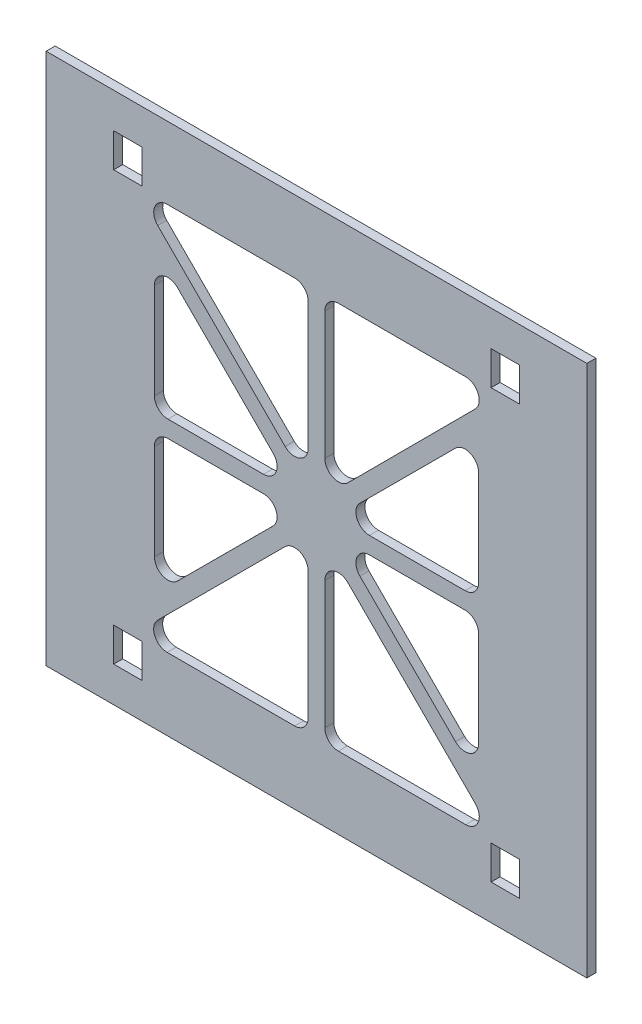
ISO-10303-21;
HEADER;
FILE_DESCRIPTION(('STEP AP214'),'2;1');
FILE_NAME('part.step','',(''),(''),'','','');
FILE_SCHEMA(('AUTOMOTIVE_DESIGN { 1 0 10303 214 1 1 1 1 }'));
ENDSEC;
DATA;
#1=APPLICATION_CONTEXT('core data for automotive mechanical design processes');
#2=APPLICATION_PROTOCOL_DEFINITION('international standard','automotive_design',2000,#1);
#3=PRODUCT_CONTEXT('',#1,'mechanical');
#4=PRODUCT('Part','Part','',(#3));
#5=PRODUCT_RELATED_PRODUCT_CATEGORY('part','',(#4));
#6=PRODUCT_DEFINITION_FORMATION('','',#4);
#7=PRODUCT_DEFINITION_CONTEXT('part definition',#1,'design');
#8=PRODUCT_DEFINITION('design','',#6,#7);
#9=PRODUCT_DEFINITION_SHAPE('','',#8);
#10=(LENGTH_UNIT() NAMED_UNIT(*) SI_UNIT(.MILLI.,.METRE.));
#11=(NAMED_UNIT(*) PLANE_ANGLE_UNIT() SI_UNIT($,.RADIAN.));
#12=(NAMED_UNIT(*) SI_UNIT($,.STERADIAN.) SOLID_ANGLE_UNIT());
#13=UNCERTAINTY_MEASURE_WITH_UNIT(LENGTH_MEASURE(1.E-05),#10,'distance_accuracy_value','');
#14=(GEOMETRIC_REPRESENTATION_CONTEXT(3) GLOBAL_UNCERTAINTY_ASSIGNED_CONTEXT((#13)) GLOBAL_UNIT_ASSIGNED_CONTEXT((#10,
#11,#12)) REPRESENTATION_CONTEXT('',''));
#15=CARTESIAN_POINT('',(0.,0.,0.));
#16=DIRECTION('',(0.,0.,1.));
#17=DIRECTION('',(1.,0.,0.));
#18=AXIS2_PLACEMENT_3D('',#15,#16,#17);
#19=CARTESIAN_POINT('',(0.,174.6116,-1.6));
#20=DIRECTION('',(0.,-1.,0.));
#21=DIRECTION('',(0.,0.,-1.));
#22=AXIS2_PLACEMENT_3D('',#19,#20,#21);
#23=PLANE('',#22);
#24=DIRECTION('',(1.,0.,0.));
#25=VECTOR('',#24,1.);
#26=CARTESIAN_POINT('',(0.,174.6116,0.));
#27=LINE('',#26,#25);
#28=CARTESIAN_POINT('',(-1.016,174.6116,0.));
#29=VERTEX_POINT('',#28);
#30=CARTESIAN_POINT('',(94.968,174.6116,0.));
#31=VERTEX_POINT('',#30);
#32=EDGE_CURVE('E683',#29,#31,#27,.T.);
#33=ORIENTED_EDGE('',*,*,#32,.T.);
#34=DIRECTION('',(0.,0.,1.));
#35=VECTOR('',#34,1.);
#36=CARTESIAN_POINT('',(94.968,174.6116,-1.6));
#37=LINE('',#36,#35);
#38=CARTESIAN_POINT('',(94.968,174.6116,-1.6));
#39=VERTEX_POINT('',#38);
#40=EDGE_CURVE('E11',#39,#31,#37,.T.);
#41=ORIENTED_EDGE('',*,*,#40,.F.);
#42=DIRECTION('',(1.,0.,0.));
#43=VECTOR('',#42,1.);
#44=CARTESIAN_POINT('',(0.,174.6116,-1.6));
#45=LINE('',#44,#43);
#46=CARTESIAN_POINT('',(-1.016,174.6116,-1.6));
#47=VERTEX_POINT('',#46);
#48=EDGE_CURVE('E487',#47,#39,#45,.T.);
#49=ORIENTED_EDGE('',*,*,#48,.F.);
#50=DIRECTION('',(0.,0.,1.));
#51=VECTOR('',#50,1.);
#52=CARTESIAN_POINT('',(-1.016,174.6116,-1.6));
#53=LINE('',#52,#51);
#54=EDGE_CURVE('E482',#47,#29,#53,.T.);
#55=ORIENTED_EDGE('',*,*,#54,.T.);
#56=EDGE_LOOP('',(#33,#41,#49,#55));
#57=FACE_BOUND('',#56,.T.);
#58=ADVANCED_FACE('F37',(#57),#23,.F.);
#59=CARTESIAN_POINT('',(94.968,0.,-1.6));
#60=DIRECTION('',(-1.,0.,0.));
#61=DIRECTION('',(0.,-1.,0.));
#62=AXIS2_PLACEMENT_3D('',#59,#60,#61);
#63=PLANE('',#62);
#64=DIRECTION('',(0.,-1.,0.));
#65=VECTOR('',#64,1.);
#66=CARTESIAN_POINT('',(94.968,0.,0.));
#67=LINE('',#66,#65);
#68=CARTESIAN_POINT('',(94.968,80.122,0.));
#69=VERTEX_POINT('',#68);
#70=EDGE_CURVE('E261',#31,#69,#67,.T.);
#71=ORIENTED_EDGE('',*,*,#70,.T.);
#72=DIRECTION('',(0.,0.,1.));
#73=VECTOR('',#72,1.);
#74=CARTESIAN_POINT('',(94.968,80.122,-1.6));
#75=LINE('',#74,#73);
#76=CARTESIAN_POINT('',(94.968,80.122,-1.6));
#77=VERTEX_POINT('',#76);
#78=EDGE_CURVE('E47',#77,#69,#75,.T.);
#79=ORIENTED_EDGE('',*,*,#78,.F.);
#80=DIRECTION('',(0.,-1.,0.));
#81=VECTOR('',#80,1.);
#82=CARTESIAN_POINT('',(94.968,0.,-1.6));
#83=LINE('',#82,#81);
#84=EDGE_CURVE('E55',#39,#77,#83,.T.);
#85=ORIENTED_EDGE('',*,*,#84,.F.);
#86=ORIENTED_EDGE('',*,*,#40,.T.);
#87=EDGE_LOOP('',(#71,#79,#85,#86));
#88=FACE_BOUND('',#87,.T.);
#89=ADVANCED_FACE('F1048',(#88),#63,.F.);
#90=CARTESIAN_POINT('',(0.,80.122,-1.6));
#91=DIRECTION('',(0.,1.,0.));
#92=DIRECTION('',(0.,0.,1.));
#93=AXIS2_PLACEMENT_3D('',#90,#91,#92);
#94=PLANE('',#93);
#95=DIRECTION('',(-1.,0.,0.));
#96=VECTOR('',#95,1.);
#97=CARTESIAN_POINT('',(0.,80.122,0.));
#98=LINE('',#97,#96);
#99=CARTESIAN_POINT('',(-1.01599999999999,80.122,0.));
#100=VERTEX_POINT('',#99);
#101=EDGE_CURVE('E479',#69,#100,#98,.T.);
#102=ORIENTED_EDGE('',*,*,#101,.T.);
#103=DIRECTION('',(0.,0.,1.));
#104=VECTOR('',#103,1.);
#105=CARTESIAN_POINT('',(-1.01599999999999,80.122,-1.6));
#106=LINE('',#105,#104);
#107=CARTESIAN_POINT('',(-1.01599999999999,80.122,-1.6));
#108=VERTEX_POINT('',#107);
#109=EDGE_CURVE('E477',#108,#100,#106,.T.);
#110=ORIENTED_EDGE('',*,*,#109,.F.);
#111=DIRECTION('',(-1.,0.,0.));
#112=VECTOR('',#111,1.);
#113=CARTESIAN_POINT('',(0.,80.122,-1.6));
#114=LINE('',#113,#112);
#115=EDGE_CURVE('E468',#77,#108,#114,.T.);
#116=ORIENTED_EDGE('',*,*,#115,.F.);
#117=ORIENTED_EDGE('',*,*,#78,.T.);
#118=EDGE_LOOP('',(#102,#110,#116,#117));
#119=FACE_BOUND('',#118,.T.);
#120=ADVANCED_FACE('F478',(#119),#94,.F.);
#121=CARTESIAN_POINT('',(18.2036831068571,0.,-1.6));
#122=DIRECTION('',(1.,0.,0.));
#123=DIRECTION('',(0.,0.,-1.));
#124=AXIS2_PLACEMENT_3D('',#121,#122,#123);
#125=PLANE('',#124);
#126=DIRECTION('',(0.,1.,0.));
#127=VECTOR('',#126,1.);
#128=CARTESIAN_POINT('',(18.2036831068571,0.,0.));
#129=LINE('',#128,#127);
#130=CARTESIAN_POINT('',(18.2036831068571,131.2636,0.));
#131=VERTEX_POINT('',#130);
#132=CARTESIAN_POINT('',(18.2036831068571,148.224701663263,0.));
#133=VERTEX_POINT('',#132);
#134=EDGE_CURVE('E665',#131,#133,#129,.T.);
#135=ORIENTED_EDGE('',*,*,#134,.F.);
#136=DIRECTION('',(0.,0.,1.));
#137=VECTOR('',#136,1.);
#138=CARTESIAN_POINT('',(18.2036831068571,131.2636,-1.6));
#139=LINE('',#138,#137);
#140=CARTESIAN_POINT('',(18.2036831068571,131.2636,-1.6));
#141=VERTEX_POINT('',#140);
#142=EDGE_CURVE('E693',#141,#131,#139,.T.);
#143=ORIENTED_EDGE('',*,*,#142,.F.);
#144=DIRECTION('',(0.,1.,0.));
#145=VECTOR('',#144,1.);
#146=CARTESIAN_POINT('',(18.2036831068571,0.,-1.6));
#147=LINE('',#146,#145);
#148=CARTESIAN_POINT('',(18.2036831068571,148.224701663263,-1.6));
#149=VERTEX_POINT('',#148);
#150=EDGE_CURVE('E991',#141,#149,#147,.T.);
#151=ORIENTED_EDGE('',*,*,#150,.T.);
#152=DIRECTION('',(0.,0.,1.));
#153=VECTOR('',#152,1.);
#154=CARTESIAN_POINT('',(18.2036831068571,148.224701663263,-1.6));
#155=LINE('',#154,#153);
#156=EDGE_CURVE('E703',#149,#133,#155,.T.);
#157=ORIENTED_EDGE('',*,*,#156,.T.);
#158=EDGE_LOOP('',(#135,#143,#151,#157));
#159=FACE_BOUND('',#158,.T.);
#160=ADVANCED_FACE('F1018',(#159),#125,.T.);
#161=CARTESIAN_POINT('',(20.6036831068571,131.2636,-1.6));
#162=DIRECTION('',(0.,0.,1.));
#163=DIRECTION('',(1.,0.,0.));
#164=AXIS2_PLACEMENT_3D('',#161,#162,#163);
#165=CYLINDRICAL_SURFACE('',#164,2.40000000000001);
#166=CARTESIAN_POINT('',(20.6036831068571,131.2636,0.));
#167=DIRECTION('',(0.,0.,1.));
#168=DIRECTION('',(1.,0.,0.));
#169=AXIS2_PLACEMENT_3D('',#166,#167,#168);
#170=CIRCLE('',#169,2.40000000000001);
#171=CARTESIAN_POINT('',(20.6036831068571,128.8636,0.));
#172=VERTEX_POINT('',#171);
#173=EDGE_CURVE('E680',#172,#131,#170,.F.);
#174=ORIENTED_EDGE('',*,*,#173,.F.);
#175=DIRECTION('',(0.,0.,1.));
#176=VECTOR('',#175,1.);
#177=CARTESIAN_POINT('',(20.6036831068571,128.8636,-1.6));
#178=LINE('',#177,#176);
#179=CARTESIAN_POINT('',(20.6036831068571,128.8636,-1.6));
#180=VERTEX_POINT('',#179);
#181=EDGE_CURVE('E695',#180,#172,#178,.T.);
#182=ORIENTED_EDGE('',*,*,#181,.F.);
#183=CARTESIAN_POINT('',(20.6036831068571,131.2636,-1.6));
#184=DIRECTION('',(0.,0.,1.));
#185=DIRECTION('',(1.,0.,0.));
#186=AXIS2_PLACEMENT_3D('',#183,#184,#185);
#187=CIRCLE('',#186,2.40000000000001);
#188=EDGE_CURVE('E489',#180,#141,#187,.F.);
#189=ORIENTED_EDGE('',*,*,#188,.T.);
#190=ORIENTED_EDGE('',*,*,#142,.T.);
#191=EDGE_LOOP('',(#174,#182,#189,#190));
#192=FACE_BOUND('',#191,.T.);
#193=ADVANCED_FACE('F1009',(#192),#165,.F.);
#194=CARTESIAN_POINT('',(0.,128.8636,-1.6));
#195=DIRECTION('',(0.,1.,0.));
#196=DIRECTION('',(0.,0.,1.));
#197=AXIS2_PLACEMENT_3D('',#194,#195,#196);
#198=PLANE('',#197);
#199=DIRECTION('',(-1.,0.,0.));
#200=VECTOR('',#199,1.);
#201=CARTESIAN_POINT('',(0.,128.8636,0.));
#202=LINE('',#201,#200);
#203=CARTESIAN_POINT('',(37.5837016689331,128.8636,0.));
#204=VERTEX_POINT('',#203);
#205=EDGE_CURVE('E677',#204,#172,#202,.T.);
#206=ORIENTED_EDGE('',*,*,#205,.F.);
#207=DIRECTION('',(0.,0.,1.));
#208=VECTOR('',#207,1.);
#209=CARTESIAN_POINT('',(37.5837016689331,128.8636,-1.6));
#210=LINE('',#209,#208);
#211=CARTESIAN_POINT('',(37.5837016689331,128.8636,-1.6));
#212=VERTEX_POINT('',#211);
#213=EDGE_CURVE('E697',#212,#204,#210,.T.);
#214=ORIENTED_EDGE('',*,*,#213,.F.);
#215=DIRECTION('',(-1.,0.,0.));
#216=VECTOR('',#215,1.);
#217=CARTESIAN_POINT('',(0.,128.8636,-1.6));
#218=LINE('',#217,#216);
#219=EDGE_CURVE('E1003',#212,#180,#218,.T.);
#220=ORIENTED_EDGE('',*,*,#219,.T.);
#221=ORIENTED_EDGE('',*,*,#181,.T.);
#222=EDGE_LOOP('',(#206,#214,#220,#221));
#223=FACE_BOUND('',#222,.T.);
#224=ADVANCED_FACE('F1024',(#223),#198,.T.);
#225=CARTESIAN_POINT('',(37.5837016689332,131.2636,-1.6));
#226=DIRECTION('',(0.,0.,1.));
#227=DIRECTION('',(1.,0.,0.));
#228=AXIS2_PLACEMENT_3D('',#225,#226,#227);
#229=CYLINDRICAL_SURFACE('',#228,2.4);
#230=CARTESIAN_POINT('',(37.5837016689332,131.2636,0.));
#231=DIRECTION('',(0.,0.,1.));
#232=DIRECTION('',(1.,0.,0.));
#233=AXIS2_PLACEMENT_3D('',#230,#231,#232);
#234=CIRCLE('',#233,2.4);
#235=CARTESIAN_POINT('',(39.2798118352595,132.961601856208,0.));
#236=VERTEX_POINT('',#235);
#237=EDGE_CURVE('E674',#236,#204,#234,.F.);
#238=ORIENTED_EDGE('',*,*,#237,.F.);
#239=DIRECTION('',(0.,0.,1.));
#240=VECTOR('',#239,1.);
#241=CARTESIAN_POINT('',(39.2798118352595,132.961601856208,-1.6));
#242=LINE('',#241,#240);
#243=CARTESIAN_POINT('',(39.2798118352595,132.961601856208,-1.6));
#244=VERTEX_POINT('',#243);
#245=EDGE_CURVE('E699',#244,#236,#242,.T.);
#246=ORIENTED_EDGE('',*,*,#245,.F.);
#247=CARTESIAN_POINT('',(37.5837016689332,131.2636,-1.6));
#248=DIRECTION('',(0.,0.,1.));
#249=DIRECTION('',(1.,0.,0.));
#250=AXIS2_PLACEMENT_3D('',#247,#248,#249);
#251=CIRCLE('',#250,2.4);
#252=EDGE_CURVE('E1000',#244,#212,#251,.F.);
#253=ORIENTED_EDGE('',*,*,#252,.T.);
#254=ORIENTED_EDGE('',*,*,#213,.T.);
#255=EDGE_LOOP('',(#238,#246,#253,#254));
#256=FACE_BOUND('',#255,.T.);
#257=ADVANCED_FACE('F1026',(#256),#229,.F.);
#258=CARTESIAN_POINT('',(86.0987731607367,86.1948000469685,-1.6));
#259=DIRECTION('',(-0.706712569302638,-0.707500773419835,0.));
#260=DIRECTION('',(0.707500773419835,-0.706712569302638,0.));
#261=AXIS2_PLACEMENT_3D('',#258,#259,#260);
#262=PLANE('',#261);
#263=DIRECTION('',(0.707500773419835,-0.706712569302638,0.));
#264=VECTOR('',#263,1.);
#265=CARTESIAN_POINT('',(86.0987731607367,86.1948000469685,0.));
#266=LINE('',#265,#264);
#267=CARTESIAN_POINT('',(22.2997932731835,149.922703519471,0.));
#268=VERTEX_POINT('',#267);
#269=EDGE_CURVE('E671',#268,#236,#266,.T.);
#270=ORIENTED_EDGE('',*,*,#269,.F.);
#271=DIRECTION('',(0.,0.,1.));
#272=VECTOR('',#271,1.);
#273=CARTESIAN_POINT('',(22.2997932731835,149.922703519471,-1.6));
#274=LINE('',#273,#272);
#275=CARTESIAN_POINT('',(22.2997932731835,149.922703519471,-1.6));
#276=VERTEX_POINT('',#275);
#277=EDGE_CURVE('E701',#276,#268,#274,.T.);
#278=ORIENTED_EDGE('',*,*,#277,.F.);
#279=DIRECTION('',(0.707500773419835,-0.706712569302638,0.));
#280=VECTOR('',#279,1.);
#281=CARTESIAN_POINT('',(86.0987731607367,86.1948000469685,-1.6));
#282=LINE('',#281,#280);
#283=EDGE_CURVE('E997',#276,#244,#282,.T.);
#284=ORIENTED_EDGE('',*,*,#283,.T.);
#285=ORIENTED_EDGE('',*,*,#245,.T.);
#286=EDGE_LOOP('',(#270,#278,#284,#285));
#287=FACE_BOUND('',#286,.T.);
#288=ADVANCED_FACE('F1029',(#287),#262,.T.);
#289=CARTESIAN_POINT('',(0.,92.933270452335,-1.6));
#290=DIRECTION('',(0.,1.,0.));
#291=DIRECTION('',(0.,0.,1.));
#292=AXIS2_PLACEMENT_3D('',#289,#290,#291);
#293=PLANE('',#292);
#294=DIRECTION('',(-1.,0.,0.));
#295=VECTOR('',#294,1.);
#296=CARTESIAN_POINT('',(0.,92.933270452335,0.));
#297=LINE('',#296,#295);
#298=CARTESIAN_POINT('',(43.0944,92.933270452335,0.));
#299=VERTEX_POINT('',#298);
#300=CARTESIAN_POINT('',(20.4669830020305,92.933270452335,0.));
#301=VERTEX_POINT('',#300);
#302=EDGE_CURVE('E647',#299,#301,#297,.T.);
#303=ORIENTED_EDGE('',*,*,#302,.F.);
#304=DIRECTION('',(0.,0.,1.));
#305=VECTOR('',#304,1.);
#306=CARTESIAN_POINT('',(43.0944,92.933270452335,-1.6));
#307=LINE('',#306,#305);
#308=CARTESIAN_POINT('',(43.0944,92.933270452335,-1.6));
#309=VERTEX_POINT('',#308);
#310=EDGE_CURVE('E705',#309,#299,#307,.T.);
#311=ORIENTED_EDGE('',*,*,#310,.F.);
#312=DIRECTION('',(-1.,0.,0.));
#313=VECTOR('',#312,1.);
#314=CARTESIAN_POINT('',(0.,92.933270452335,-1.6));
#315=LINE('',#314,#313);
#316=CARTESIAN_POINT('',(20.4669830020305,92.933270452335,-1.6));
#317=VERTEX_POINT('',#316);
#318=EDGE_CURVE('E973',#309,#317,#315,.T.);
#319=ORIENTED_EDGE('',*,*,#318,.T.);
#320=DIRECTION('',(0.,0.,1.));
#321=VECTOR('',#320,1.);
#322=CARTESIAN_POINT('',(20.4669830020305,92.933270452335,-1.6));
#323=LINE('',#322,#321);
#324=EDGE_CURVE('E715',#317,#301,#323,.T.);
#325=ORIENTED_EDGE('',*,*,#324,.T.);
#326=EDGE_LOOP('',(#303,#311,#319,#325));
#327=FACE_BOUND('',#326,.T.);
#328=ADVANCED_FACE('F1064',(#327),#293,.T.);
#329=CARTESIAN_POINT('',(43.0944,95.333270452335,-1.6));
#330=DIRECTION('',(0.,0.,1.));
#331=DIRECTION('',(1.,0.,0.));
#332=AXIS2_PLACEMENT_3D('',#329,#330,#331);
#333=CYLINDRICAL_SURFACE('',#332,2.40000000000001);
#334=CARTESIAN_POINT('',(43.0944,95.333270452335,0.));
#335=DIRECTION('',(0.,0.,1.));
#336=DIRECTION('',(1.,0.,0.));
#337=AXIS2_PLACEMENT_3D('',#334,#335,#336);
#338=CIRCLE('',#337,2.40000000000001);
#339=CARTESIAN_POINT('',(45.4944,95.333270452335,0.));
#340=VERTEX_POINT('',#339);
#341=EDGE_CURVE('E662',#340,#299,#338,.F.);
#342=ORIENTED_EDGE('',*,*,#341,.F.);
#343=DIRECTION('',(0.,0.,1.));
#344=VECTOR('',#343,1.);
#345=CARTESIAN_POINT('',(45.4944,95.333270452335,-1.6));
#346=LINE('',#345,#344);
#347=CARTESIAN_POINT('',(45.4944,95.333270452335,-1.6));
#348=VERTEX_POINT('',#347);
#349=EDGE_CURVE('E707',#348,#340,#346,.T.);
#350=ORIENTED_EDGE('',*,*,#349,.F.);
#351=CARTESIAN_POINT('',(43.0944,95.333270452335,-1.6));
#352=DIRECTION('',(0.,0.,1.));
#353=DIRECTION('',(1.,0.,0.));
#354=AXIS2_PLACEMENT_3D('',#351,#352,#353);
#355=CIRCLE('',#354,2.40000000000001);
#356=EDGE_CURVE('E988',#348,#309,#355,.F.);
#357=ORIENTED_EDGE('',*,*,#356,.T.);
#358=ORIENTED_EDGE('',*,*,#310,.T.);
#359=EDGE_LOOP('',(#342,#350,#357,#358));
#360=FACE_BOUND('',#359,.T.);
#361=ADVANCED_FACE('F1068',(#360),#333,.F.);
#362=CARTESIAN_POINT('',(45.4944,0.,-1.6));
#363=DIRECTION('',(-1.,0.,0.));
#364=DIRECTION('',(0.,0.,1.));
#365=AXIS2_PLACEMENT_3D('',#362,#363,#364);
#366=PLANE('',#365);
#367=DIRECTION('',(0.,-1.,0.));
#368=VECTOR('',#367,1.);
#369=CARTESIAN_POINT('',(45.4944,0.,0.));
#370=LINE('',#369,#368);
#371=CARTESIAN_POINT('',(45.4944,117.960687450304,0.));
#372=VERTEX_POINT('',#371);
#373=EDGE_CURVE('E659',#372,#340,#370,.T.);
#374=ORIENTED_EDGE('',*,*,#373,.F.);
#375=DIRECTION('',(0.,0.,1.));
#376=VECTOR('',#375,1.);
#377=CARTESIAN_POINT('',(45.4944,117.960687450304,-1.6));
#378=LINE('',#377,#376);
#379=CARTESIAN_POINT('',(45.4944,117.960687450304,-1.6));
#380=VERTEX_POINT('',#379);
#381=EDGE_CURVE('E709',#380,#372,#378,.T.);
#382=ORIENTED_EDGE('',*,*,#381,.F.);
#383=DIRECTION('',(0.,-1.,0.));
#384=VECTOR('',#383,1.);
#385=CARTESIAN_POINT('',(45.4944,0.,-1.6));
#386=LINE('',#385,#384);
#387=EDGE_CURVE('E985',#380,#348,#386,.T.);
#388=ORIENTED_EDGE('',*,*,#387,.T.);
#389=ORIENTED_EDGE('',*,*,#349,.T.);
#390=EDGE_LOOP('',(#374,#382,#388,#389));
#391=FACE_BOUND('',#390,.T.);
#392=ADVANCED_FACE('F1074',(#391),#366,.T.);
#393=CARTESIAN_POINT('',(43.0944,117.960687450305,-1.6));
#394=DIRECTION('',(0.,0.,1.));
#395=DIRECTION('',(1.,0.,0.));
#396=AXIS2_PLACEMENT_3D('',#393,#394,#395);
#397=CYLINDRICAL_SURFACE('',#396,2.4);
#398=CARTESIAN_POINT('',(43.0944,117.960687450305,0.));
#399=DIRECTION('',(0.,0.,1.));
#400=DIRECTION('',(1.,0.,0.));
#401=AXIS2_PLACEMENT_3D('',#398,#399,#400);
#402=CIRCLE('',#401,2.4);
#403=CARTESIAN_POINT('',(41.3973437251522,119.657743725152,0.));
#404=VERTEX_POINT('',#403);
#405=EDGE_CURVE('E656',#404,#372,#402,.F.);
#406=ORIENTED_EDGE('',*,*,#405,.F.);
#407=DIRECTION('',(0.,0.,1.));
#408=VECTOR('',#407,1.);
#409=CARTESIAN_POINT('',(41.3973437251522,119.657743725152,-1.6));
#410=LINE('',#409,#408);
#411=CARTESIAN_POINT('',(41.3973437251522,119.657743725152,-1.6));
#412=VERTEX_POINT('',#411);
#413=EDGE_CURVE('E711',#412,#404,#410,.T.);
#414=ORIENTED_EDGE('',*,*,#413,.F.);
#415=CARTESIAN_POINT('',(43.0944,117.960687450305,-1.6));
#416=DIRECTION('',(0.,0.,1.));
#417=DIRECTION('',(1.,0.,0.));
#418=AXIS2_PLACEMENT_3D('',#415,#416,#417);
#419=CIRCLE('',#418,2.4);
#420=EDGE_CURVE('E982',#412,#380,#419,.F.);
#421=ORIENTED_EDGE('',*,*,#420,.T.);
#422=ORIENTED_EDGE('',*,*,#381,.T.);
#423=EDGE_LOOP('',(#406,#414,#421,#422));
#424=FACE_BOUND('',#423,.T.);
#425=ADVANCED_FACE('F1294',(#424),#397,.F.);
#426=CARTESIAN_POINT('',(-39.1302,39.1302000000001,-1.6));
#427=DIRECTION('',(0.707106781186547,-0.707106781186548,0.));
#428=DIRECTION('',(0.707106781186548,0.707106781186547,0.));
#429=AXIS2_PLACEMENT_3D('',#426,#427,#428);
#430=PLANE('',#429);
#431=DIRECTION('',(0.707106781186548,0.707106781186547,0.));
#432=VECTOR('',#431,1.);
#433=CARTESIAN_POINT('',(-39.1302,39.1302000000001,0.));
#434=LINE('',#433,#432);
#435=CARTESIAN_POINT('',(18.7699267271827,97.0303267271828,0.));
#436=VERTEX_POINT('',#435);
#437=EDGE_CURVE('E653',#436,#404,#434,.T.);
#438=ORIENTED_EDGE('',*,*,#437,.F.);
#439=DIRECTION('',(0.,0.,1.));
#440=VECTOR('',#439,1.);
#441=CARTESIAN_POINT('',(18.7699267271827,97.0303267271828,-1.6));
#442=LINE('',#441,#440);
#443=CARTESIAN_POINT('',(18.7699267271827,97.0303267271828,-1.6));
#444=VERTEX_POINT('',#443);
#445=EDGE_CURVE('E713',#444,#436,#442,.T.);
#446=ORIENTED_EDGE('',*,*,#445,.F.);
#447=DIRECTION('',(0.707106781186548,0.707106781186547,0.));
#448=VECTOR('',#447,1.);
#449=CARTESIAN_POINT('',(-39.1302,39.1302000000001,-1.6));
#450=LINE('',#449,#448);
#451=EDGE_CURVE('E979',#444,#412,#450,.T.);
#452=ORIENTED_EDGE('',*,*,#451,.T.);
#453=ORIENTED_EDGE('',*,*,#413,.T.);
#454=EDGE_LOOP('',(#438,#446,#452,#453));
#455=FACE_BOUND('',#454,.T.);
#456=ADVANCED_FACE('F1104',(#455),#430,.T.);
#457=CARTESIAN_POINT('',(75.7478033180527,0.,-1.6));
#458=DIRECTION('',(-1.,0.,0.));
#459=DIRECTION('',(0.,0.,1.));
#460=AXIS2_PLACEMENT_3D('',#457,#458,#459);
#461=PLANE('',#460);
#462=DIRECTION('',(0.,-1.,0.));
#463=VECTOR('',#462,1.);
#464=CARTESIAN_POINT('',(75.7478033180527,0.,0.));
#465=LINE('',#464,#463);
#466=CARTESIAN_POINT('',(75.7478033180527,123.4716,0.));
#467=VERTEX_POINT('',#466);
#468=CARTESIAN_POINT('',(75.7478033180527,106.509972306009,0.));
#469=VERTEX_POINT('',#468);
#470=EDGE_CURVE('E629',#467,#469,#465,.T.);
#471=ORIENTED_EDGE('',*,*,#470,.F.);
#472=DIRECTION('',(0.,0.,1.));
#473=VECTOR('',#472,1.);
#474=CARTESIAN_POINT('',(75.7478033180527,123.4716,-1.6));
#475=LINE('',#474,#473);
#476=CARTESIAN_POINT('',(75.7478033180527,123.4716,-1.6));
#477=VERTEX_POINT('',#476);
#478=EDGE_CURVE('E717',#477,#467,#475,.T.);
#479=ORIENTED_EDGE('',*,*,#478,.F.);
#480=DIRECTION('',(0.,-1.,0.));
#481=VECTOR('',#480,1.);
#482=CARTESIAN_POINT('',(75.7478033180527,0.,-1.6));
#483=LINE('',#482,#481);
#484=CARTESIAN_POINT('',(75.7478033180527,106.509972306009,-1.6));
#485=VERTEX_POINT('',#484);
#486=EDGE_CURVE('E956',#477,#485,#483,.T.);
#487=ORIENTED_EDGE('',*,*,#486,.T.);
#488=DIRECTION('',(0.,0.,1.));
#489=VECTOR('',#488,1.);
#490=CARTESIAN_POINT('',(75.7478033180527,106.509972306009,-1.6));
#491=LINE('',#490,#489);
#492=EDGE_CURVE('E727',#485,#469,#491,.T.);
#493=ORIENTED_EDGE('',*,*,#492,.T.);
#494=EDGE_LOOP('',(#471,#479,#487,#493));
#495=FACE_BOUND('',#494,.T.);
#496=ADVANCED_FACE('F1084',(#495),#461,.T.);
#497=CARTESIAN_POINT('',(73.3478033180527,123.4716,-1.6));
#498=DIRECTION('',(0.,0.,1.));
#499=DIRECTION('',(1.,0.,0.));
#500=AXIS2_PLACEMENT_3D('',#497,#498,#499);
#501=CYLINDRICAL_SURFACE('',#500,2.40000000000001);
#502=CARTESIAN_POINT('',(73.3478033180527,123.4716,0.));
#503=DIRECTION('',(0.,0.,1.));
#504=DIRECTION('',(1.,0.,0.));
#505=AXIS2_PLACEMENT_3D('',#502,#503,#504);
#506=CIRCLE('',#505,2.40000000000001);
#507=CARTESIAN_POINT('',(73.3478033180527,125.8716,0.));
#508=VERTEX_POINT('',#507);
#509=EDGE_CURVE('E644',#467,#508,#506,.T.);
#510=ORIENTED_EDGE('',*,*,#509,.T.);
#511=DIRECTION('',(0.,0.,1.));
#512=VECTOR('',#511,1.);
#513=CARTESIAN_POINT('',(73.3478033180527,125.8716,-1.6));
#514=LINE('',#513,#512);
#515=CARTESIAN_POINT('',(73.3478033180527,125.8716,-1.6));
#516=VERTEX_POINT('',#515);
#517=EDGE_CURVE('E719',#516,#508,#514,.T.);
#518=ORIENTED_EDGE('',*,*,#517,.F.);
#519=CARTESIAN_POINT('',(73.3478033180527,123.4716,-1.6));
#520=DIRECTION('',(0.,0.,1.));
#521=DIRECTION('',(1.,0.,0.));
#522=AXIS2_PLACEMENT_3D('',#519,#520,#521);
#523=CIRCLE('',#522,2.40000000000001);
#524=EDGE_CURVE('E971',#477,#516,#523,.T.);
#525=ORIENTED_EDGE('',*,*,#524,.F.);
#526=ORIENTED_EDGE('',*,*,#478,.T.);
#527=EDGE_LOOP('',(#510,#518,#525,#526));
#528=FACE_BOUND('',#527,.T.);
#529=ADVANCED_FACE('F1080',(#528),#501,.F.);
#530=CARTESIAN_POINT('',(0.,125.8716,-1.6));
#531=DIRECTION('',(0.,-1.,0.));
#532=DIRECTION('',(0.,0.,-1.));
#533=AXIS2_PLACEMENT_3D('',#530,#531,#532);
#534=PLANE('',#533);
#535=DIRECTION('',(1.,0.,0.));
#536=VECTOR('',#535,1.);
#537=CARTESIAN_POINT('',(0.,125.8716,0.));
#538=LINE('',#537,#536);
#539=CARTESIAN_POINT('',(56.368310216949,125.8716,0.));
#540=VERTEX_POINT('',#539);
#541=EDGE_CURVE('E641',#540,#508,#538,.T.);
#542=ORIENTED_EDGE('',*,*,#541,.F.);
#543=DIRECTION('',(0.,0.,1.));
#544=VECTOR('',#543,1.);
#545=CARTESIAN_POINT('',(56.368310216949,125.8716,-1.6));
#546=LINE('',#545,#544);
#547=CARTESIAN_POINT('',(56.368310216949,125.8716,-1.6));
#548=VERTEX_POINT('',#547);
#549=EDGE_CURVE('E721',#548,#540,#546,.T.);
#550=ORIENTED_EDGE('',*,*,#549,.F.);
#551=DIRECTION('',(1.,0.,0.));
#552=VECTOR('',#551,1.);
#553=CARTESIAN_POINT('',(0.,125.8716,-1.6));
#554=LINE('',#553,#552);
#555=EDGE_CURVE('E968',#548,#516,#554,.T.);
#556=ORIENTED_EDGE('',*,*,#555,.T.);
#557=ORIENTED_EDGE('',*,*,#517,.T.);
#558=EDGE_LOOP('',(#542,#550,#556,#557));
#559=FACE_BOUND('',#558,.T.);
#560=ADVANCED_FACE('F1083',(#559),#534,.T.);
#561=CARTESIAN_POINT('',(56.3683102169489,123.4716,-1.6));
#562=DIRECTION('',(0.,0.,1.));
#563=DIRECTION('',(1.,0.,0.));
#564=AXIS2_PLACEMENT_3D('',#561,#562,#563);
#565=CYLINDRICAL_SURFACE('',#564,2.40000000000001);
#566=CARTESIAN_POINT('',(56.3683102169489,123.4716,0.));
#567=DIRECTION('',(0.,0.,1.));
#568=DIRECTION('',(1.,0.,0.));
#569=AXIS2_PLACEMENT_3D('',#566,#567,#568);
#570=CIRCLE('',#569,2.40000000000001);
#571=CARTESIAN_POINT('',(54.6721474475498,121.77365068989,0.));
#572=VERTEX_POINT('',#571);
#573=EDGE_CURVE('E638',#572,#540,#570,.F.);
#574=ORIENTED_EDGE('',*,*,#573,.F.);
#575=DIRECTION('',(0.,0.,1.));
#576=VECTOR('',#575,1.);
#577=CARTESIAN_POINT('',(54.6721474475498,121.77365068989,-1.6));
#578=LINE('',#577,#576);
#579=CARTESIAN_POINT('',(54.6721474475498,121.77365068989,-1.6));
#580=VERTEX_POINT('',#579);
#581=EDGE_CURVE('E723',#580,#572,#578,.T.);
#582=ORIENTED_EDGE('',*,*,#581,.F.);
#583=CARTESIAN_POINT('',(56.3683102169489,123.4716,-1.6));
#584=DIRECTION('',(0.,0.,1.));
#585=DIRECTION('',(1.,0.,0.));
#586=AXIS2_PLACEMENT_3D('',#583,#584,#585);
#587=CIRCLE('',#586,2.40000000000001);
#588=EDGE_CURVE('E965',#580,#548,#587,.F.);
#589=ORIENTED_EDGE('',*,*,#588,.T.);
#590=ORIENTED_EDGE('',*,*,#549,.T.);
#591=EDGE_LOOP('',(#574,#582,#589,#590));
#592=FACE_BOUND('',#591,.T.);
#593=ADVANCED_FACE('F1088',(#592),#565,.F.);
#594=CARTESIAN_POINT('',(88.1940878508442,88.2869812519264,-1.6));
#595=DIRECTION('',(0.706734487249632,0.707478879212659,0.));
#596=DIRECTION('',(-0.707478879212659,0.706734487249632,0.));
#597=AXIS2_PLACEMENT_3D('',#594,#595,#596);
#598=PLANE('',#597);
#599=DIRECTION('',(-0.707478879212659,0.706734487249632,0.));
#600=VECTOR('',#599,1.);
#601=CARTESIAN_POINT('',(88.1940878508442,88.2869812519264,0.));
#602=LINE('',#601,#600);
#603=CARTESIAN_POINT('',(71.6516405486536,104.812022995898,0.));
#604=VERTEX_POINT('',#603);
#605=EDGE_CURVE('E635',#604,#572,#602,.T.);
#606=ORIENTED_EDGE('',*,*,#605,.F.);
#607=DIRECTION('',(0.,0.,1.));
#608=VECTOR('',#607,1.);
#609=CARTESIAN_POINT('',(71.6516405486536,104.812022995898,-1.6));
#610=LINE('',#609,#608);
#611=CARTESIAN_POINT('',(71.6516405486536,104.812022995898,-1.6));
#612=VERTEX_POINT('',#611);
#613=EDGE_CURVE('E725',#612,#604,#610,.T.);
#614=ORIENTED_EDGE('',*,*,#613,.F.);
#615=DIRECTION('',(-0.707478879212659,0.706734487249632,0.));
#616=VECTOR('',#615,1.);
#617=CARTESIAN_POINT('',(88.1940878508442,88.2869812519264,-1.6));
#618=LINE('',#617,#616);
#619=EDGE_CURVE('E962',#612,#580,#618,.T.);
#620=ORIENTED_EDGE('',*,*,#619,.T.);
#621=ORIENTED_EDGE('',*,*,#581,.T.);
#622=EDGE_LOOP('',(#606,#614,#620,#621));
#623=FACE_BOUND('',#622,.T.);
#624=ADVANCED_FACE('F1092',(#623),#598,.T.);
#625=CARTESIAN_POINT('',(56.3682983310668,131.2636,-1.6));
#626=DIRECTION('',(0.,0.,1.));
#627=DIRECTION('',(1.,0.,0.));
#628=AXIS2_PLACEMENT_3D('',#625,#626,#627);
#629=CYLINDRICAL_SURFACE('',#628,2.40000000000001);
#630=CARTESIAN_POINT('',(56.3682983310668,131.2636,0.));
#631=DIRECTION('',(0.,0.,1.));
#632=DIRECTION('',(1.,0.,0.));
#633=AXIS2_PLACEMENT_3D('',#630,#631,#632);
#634=CIRCLE('',#633,2.40000000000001);
#635=CARTESIAN_POINT('',(54.6721881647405,132.961601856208,0.));
#636=VERTEX_POINT('',#635);
#637=CARTESIAN_POINT('',(56.3682983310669,128.8636,0.));
#638=VERTEX_POINT('',#637);
#639=EDGE_CURVE('E611',#636,#638,#634,.T.);
#640=ORIENTED_EDGE('',*,*,#639,.T.);
#641=DIRECTION('',(0.,0.,1.));
#642=VECTOR('',#641,1.);
#643=CARTESIAN_POINT('',(56.3682983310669,128.8636,-1.6));
#644=LINE('',#643,#642);
#645=CARTESIAN_POINT('',(56.3682983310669,128.8636,-1.6));
#646=VERTEX_POINT('',#645);
#647=EDGE_CURVE('E729',#646,#638,#644,.T.);
#648=ORIENTED_EDGE('',*,*,#647,.F.);
#649=CARTESIAN_POINT('',(56.3682983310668,131.2636,-1.6));
#650=DIRECTION('',(0.,0.,1.));
#651=DIRECTION('',(1.,0.,0.));
#652=AXIS2_PLACEMENT_3D('',#649,#650,#651);
#653=CIRCLE('',#652,2.40000000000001);
#654=CARTESIAN_POINT('',(54.6721881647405,132.961601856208,-1.6));
#655=VERTEX_POINT('',#654);
#656=EDGE_CURVE('E941',#655,#646,#653,.T.);
#657=ORIENTED_EDGE('',*,*,#656,.F.);
#658=DIRECTION('',(0.,0.,1.));
#659=VECTOR('',#658,1.);
#660=CARTESIAN_POINT('',(54.6721881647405,132.961601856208,-1.6));
#661=LINE('',#660,#659);
#662=EDGE_CURVE('E739',#655,#636,#661,.T.);
#663=ORIENTED_EDGE('',*,*,#662,.T.);
#664=EDGE_LOOP('',(#640,#648,#657,#663));
#665=FACE_BOUND('',#664,.T.);
#666=ADVANCED_FACE('F1096',(#665),#629,.F.);
#667=CARTESIAN_POINT('',(0.,128.8636,-1.6));
#668=DIRECTION('',(0.,1.,0.));
#669=DIRECTION('',(0.,0.,1.));
#670=AXIS2_PLACEMENT_3D('',#667,#668,#669);
#671=PLANE('',#670);
#672=DIRECTION('',(-1.,0.,0.));
#673=VECTOR('',#672,1.);
#674=CARTESIAN_POINT('',(0.,128.8636,0.));
#675=LINE('',#674,#673);
#676=CARTESIAN_POINT('',(73.3483168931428,128.8636,0.));
#677=VERTEX_POINT('',#676);
#678=EDGE_CURVE('E626',#677,#638,#675,.T.);
#679=ORIENTED_EDGE('',*,*,#678,.F.);
#680=DIRECTION('',(0.,0.,1.));
#681=VECTOR('',#680,1.);
#682=CARTESIAN_POINT('',(73.3483168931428,128.8636,-1.6));
#683=LINE('',#682,#681);
#684=CARTESIAN_POINT('',(73.3483168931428,128.8636,-1.6));
#685=VERTEX_POINT('',#684);
#686=EDGE_CURVE('E731',#685,#677,#683,.T.);
#687=ORIENTED_EDGE('',*,*,#686,.F.);
#688=DIRECTION('',(-1.,0.,0.));
#689=VECTOR('',#688,1.);
#690=CARTESIAN_POINT('',(0.,128.8636,-1.6));
#691=LINE('',#690,#689);
#692=EDGE_CURVE('E953',#685,#646,#691,.T.);
#693=ORIENTED_EDGE('',*,*,#692,.T.);
#694=ORIENTED_EDGE('',*,*,#647,.T.);
#695=EDGE_LOOP('',(#679,#687,#693,#694));
#696=FACE_BOUND('',#695,.T.);
#697=ADVANCED_FACE('F1106',(#696),#671,.T.);
#698=CARTESIAN_POINT('',(73.3483168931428,131.2636,-1.6));
#699=DIRECTION('',(0.,0.,1.));
#700=DIRECTION('',(1.,0.,0.));
#701=AXIS2_PLACEMENT_3D('',#698,#699,#700);
#702=CYLINDRICAL_SURFACE('',#701,2.39999999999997);
#703=CARTESIAN_POINT('',(73.3483168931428,131.2636,0.));
#704=DIRECTION('',(0.,0.,1.));
#705=DIRECTION('',(1.,0.,0.));
#706=AXIS2_PLACEMENT_3D('',#703,#704,#705);
#707=CIRCLE('',#706,2.39999999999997);
#708=CARTESIAN_POINT('',(75.7483168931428,131.2636,0.));
#709=VERTEX_POINT('',#708);
#710=EDGE_CURVE('E623',#677,#709,#707,.T.);
#711=ORIENTED_EDGE('',*,*,#710,.T.);
#712=DIRECTION('',(0.,0.,1.));
#713=VECTOR('',#712,1.);
#714=CARTESIAN_POINT('',(75.7483168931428,131.2636,-1.6));
#715=LINE('',#714,#713);
#716=CARTESIAN_POINT('',(75.7483168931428,131.2636,-1.6));
#717=VERTEX_POINT('',#716);
#718=EDGE_CURVE('E733',#717,#709,#715,.T.);
#719=ORIENTED_EDGE('',*,*,#718,.F.);
#720=CARTESIAN_POINT('',(73.3483168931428,131.2636,-1.6));
#721=DIRECTION('',(0.,0.,1.));
#722=DIRECTION('',(1.,0.,0.));
#723=AXIS2_PLACEMENT_3D('',#720,#721,#722);
#724=CIRCLE('',#723,2.39999999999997);
#725=EDGE_CURVE('E951',#685,#717,#724,.T.);
#726=ORIENTED_EDGE('',*,*,#725,.F.);
#727=ORIENTED_EDGE('',*,*,#686,.T.);
#728=EDGE_LOOP('',(#711,#719,#726,#727));
#729=FACE_BOUND('',#728,.T.);
#730=ADVANCED_FACE('F1109',(#729),#702,.F.);
#731=CARTESIAN_POINT('',(75.7483168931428,0.,-1.6));
#732=DIRECTION('',(-1.,0.,0.));
#733=DIRECTION('',(0.,0.,1.));
#734=AXIS2_PLACEMENT_3D('',#731,#732,#733);
#735=PLANE('',#734);
#736=DIRECTION('',(0.,-1.,0.));
#737=VECTOR('',#736,1.);
#738=CARTESIAN_POINT('',(75.7483168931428,0.,0.));
#739=LINE('',#738,#737);
#740=CARTESIAN_POINT('',(75.7483168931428,148.224701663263,0.));
#741=VERTEX_POINT('',#740);
#742=EDGE_CURVE('E620',#741,#709,#739,.T.);
#743=ORIENTED_EDGE('',*,*,#742,.F.);
#744=DIRECTION('',(0.,0.,1.));
#745=VECTOR('',#744,1.);
#746=CARTESIAN_POINT('',(75.7483168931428,148.224701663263,-1.6));
#747=LINE('',#746,#745);
#748=CARTESIAN_POINT('',(75.7483168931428,148.224701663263,-1.6));
#749=VERTEX_POINT('',#748);
#750=EDGE_CURVE('E735',#749,#741,#747,.T.);
#751=ORIENTED_EDGE('',*,*,#750,.F.);
#752=DIRECTION('',(0.,-1.,0.));
#753=VECTOR('',#752,1.);
#754=CARTESIAN_POINT('',(75.7483168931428,0.,-1.6));
#755=LINE('',#754,#753);
#756=EDGE_CURVE('E948',#749,#717,#755,.T.);
#757=ORIENTED_EDGE('',*,*,#756,.T.);
#758=ORIENTED_EDGE('',*,*,#718,.T.);
#759=EDGE_LOOP('',(#743,#751,#757,#758));
#760=FACE_BOUND('',#759,.T.);
#761=ADVANCED_FACE('F1113',(#760),#735,.T.);
#762=CARTESIAN_POINT('',(73.3483168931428,148.224701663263,-1.6));
#763=DIRECTION('',(0.,0.,1.));
#764=DIRECTION('',(1.,0.,0.));
#765=AXIS2_PLACEMENT_3D('',#762,#763,#764);
#766=CYLINDRICAL_SURFACE('',#765,2.39999999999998);
#767=CARTESIAN_POINT('',(73.3483168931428,148.224701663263,0.));
#768=DIRECTION('',(0.,0.,1.));
#769=DIRECTION('',(1.,0.,0.));
#770=AXIS2_PLACEMENT_3D('',#767,#768,#769);
#771=CIRCLE('',#770,2.39999999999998);
#772=CARTESIAN_POINT('',(71.6522067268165,149.922703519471,0.));
#773=VERTEX_POINT('',#772);
#774=EDGE_CURVE('E617',#741,#773,#771,.T.);
#775=ORIENTED_EDGE('',*,*,#774,.T.);
#776=DIRECTION('',(0.,0.,1.));
#777=VECTOR('',#776,1.);
#778=CARTESIAN_POINT('',(71.6522067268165,149.922703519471,-1.6));
#779=LINE('',#778,#777);
#780=CARTESIAN_POINT('',(71.6522067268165,149.922703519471,-1.6));
#781=VERTEX_POINT('',#780);
#782=EDGE_CURVE('E737',#781,#773,#779,.T.);
#783=ORIENTED_EDGE('',*,*,#782,.F.);
#784=CARTESIAN_POINT('',(73.3483168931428,148.224701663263,-1.6));
#785=DIRECTION('',(0.,0.,1.));
#786=DIRECTION('',(1.,0.,0.));
#787=AXIS2_PLACEMENT_3D('',#784,#785,#786);
#788=CIRCLE('',#787,2.39999999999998);
#789=EDGE_CURVE('E946',#749,#781,#788,.T.);
#790=ORIENTED_EDGE('',*,*,#789,.F.);
#791=ORIENTED_EDGE('',*,*,#750,.T.);
#792=EDGE_LOOP('',(#775,#783,#790,#791));
#793=FACE_BOUND('',#792,.T.);
#794=ADVANCED_FACE('F1117',(#793),#766,.F.);
#795=CARTESIAN_POINT('',(50.8576,159.397208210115,-1.6));
#796=DIRECTION('',(0.,0.,1.));
#797=DIRECTION('',(1.,0.,0.));
#798=AXIS2_PLACEMENT_3D('',#795,#796,#797);
#799=CYLINDRICAL_SURFACE('',#798,2.39999999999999);
#800=CARTESIAN_POINT('',(50.8576,159.397208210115,0.));
#801=DIRECTION('',(0.,0.,1.));
#802=DIRECTION('',(1.,0.,0.));
#803=AXIS2_PLACEMENT_3D('',#800,#801,#802);
#804=CIRCLE('',#803,2.39999999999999);
#805=CARTESIAN_POINT('',(50.8576,161.797208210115,0.));
#806=VERTEX_POINT('',#805);
#807=CARTESIAN_POINT('',(48.4576,159.397208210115,0.));
#808=VERTEX_POINT('',#807);
#809=EDGE_CURVE('E593',#806,#808,#804,.T.);
#810=ORIENTED_EDGE('',*,*,#809,.T.);
#811=DIRECTION('',(0.,0.,1.));
#812=VECTOR('',#811,1.);
#813=CARTESIAN_POINT('',(48.4576,159.397208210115,-1.6));
#814=LINE('',#813,#812);
#815=CARTESIAN_POINT('',(48.4576,159.397208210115,-1.6));
#816=VERTEX_POINT('',#815);
#817=EDGE_CURVE('E741',#816,#808,#814,.T.);
#818=ORIENTED_EDGE('',*,*,#817,.F.);
#819=CARTESIAN_POINT('',(50.8576,159.397208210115,-1.6));
#820=DIRECTION('',(0.,0.,1.));
#821=DIRECTION('',(1.,0.,0.));
#822=AXIS2_PLACEMENT_3D('',#819,#820,#821);
#823=CIRCLE('',#822,2.39999999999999);
#824=CARTESIAN_POINT('',(50.8576,161.797208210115,-1.6));
#825=VERTEX_POINT('',#824);
#826=EDGE_CURVE('E926',#825,#816,#823,.T.);
#827=ORIENTED_EDGE('',*,*,#826,.F.);
#828=DIRECTION('',(0.,0.,1.));
#829=VECTOR('',#828,1.);
#830=CARTESIAN_POINT('',(50.8576,161.797208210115,-1.6));
#831=LINE('',#830,#829);
#832=EDGE_CURVE('E751',#825,#806,#831,.T.);
#833=ORIENTED_EDGE('',*,*,#832,.T.);
#834=EDGE_LOOP('',(#810,#818,#827,#833));
#835=FACE_BOUND('',#834,.T.);
#836=ADVANCED_FACE('F1121',(#835),#799,.F.);
#837=CARTESIAN_POINT('',(48.4575999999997,0.,-1.6));
#838=DIRECTION('',(1.,0.,0.));
#839=DIRECTION('',(0.,1.,0.));
#840=AXIS2_PLACEMENT_3D('',#837,#838,#839);
#841=PLANE('',#840);
#842=DIRECTION('',(0.,1.,0.));
#843=VECTOR('',#842,1.);
#844=CARTESIAN_POINT('',(48.4575999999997,0.,0.));
#845=LINE('',#844,#843);
#846=CARTESIAN_POINT('',(48.4576,136.745297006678,0.));
#847=VERTEX_POINT('',#846);
#848=EDGE_CURVE('E608',#847,#808,#845,.T.);
#849=ORIENTED_EDGE('',*,*,#848,.F.);
#850=DIRECTION('',(0.,0.,1.));
#851=VECTOR('',#850,1.);
#852=CARTESIAN_POINT('',(48.4576,136.745297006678,-1.6));
#853=LINE('',#852,#851);
#854=CARTESIAN_POINT('',(48.4576,136.745297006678,-1.6));
#855=VERTEX_POINT('',#854);
#856=EDGE_CURVE('E743',#855,#847,#853,.T.);
#857=ORIENTED_EDGE('',*,*,#856,.F.);
#858=DIRECTION('',(0.,1.,0.));
#859=VECTOR('',#858,1.);
#860=CARTESIAN_POINT('',(48.4575999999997,0.,-1.6));
#861=LINE('',#860,#859);
#862=EDGE_CURVE('E938',#855,#816,#861,.T.);
#863=ORIENTED_EDGE('',*,*,#862,.T.);
#864=ORIENTED_EDGE('',*,*,#817,.T.);
#865=EDGE_LOOP('',(#849,#857,#863,#864));
#866=FACE_BOUND('',#865,.T.);
#867=ADVANCED_FACE('F1130',(#866),#841,.T.);
#868=CARTESIAN_POINT('',(50.8576,136.745297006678,-1.6));
#869=DIRECTION('',(0.,0.,1.));
#870=DIRECTION('',(1.,0.,0.));
#871=AXIS2_PLACEMENT_3D('',#868,#869,#870);
#872=CYLINDRICAL_SURFACE('',#871,2.39999999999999);
#873=CARTESIAN_POINT('',(50.8576,136.745297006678,0.));
#874=DIRECTION('',(0.,0.,1.));
#875=DIRECTION('',(1.,0.,0.));
#876=AXIS2_PLACEMENT_3D('',#873,#874,#875);
#877=CIRCLE('',#876,2.39999999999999);
#878=CARTESIAN_POINT('',(52.5564933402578,135.050079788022,0.));
#879=VERTEX_POINT('',#878);
#880=EDGE_CURVE('E605',#847,#879,#877,.T.);
#881=ORIENTED_EDGE('',*,*,#880,.T.);
#882=DIRECTION('',(0.,0.,1.));
#883=VECTOR('',#882,1.);
#884=CARTESIAN_POINT('',(52.5564933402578,135.050079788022,-1.6));
#885=LINE('',#884,#883);
#886=CARTESIAN_POINT('',(52.5564933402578,135.050079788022,-1.6));
#887=VERTEX_POINT('',#886);
#888=EDGE_CURVE('E745',#887,#879,#885,.T.);
#889=ORIENTED_EDGE('',*,*,#888,.F.);
#890=CARTESIAN_POINT('',(50.8576,136.745297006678,-1.6));
#891=DIRECTION('',(0.,0.,1.));
#892=DIRECTION('',(1.,0.,0.));
#893=AXIS2_PLACEMENT_3D('',#890,#891,#892);
#894=CIRCLE('',#893,2.39999999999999);
#895=EDGE_CURVE('E936',#855,#887,#894,.T.);
#896=ORIENTED_EDGE('',*,*,#895,.F.);
#897=ORIENTED_EDGE('',*,*,#856,.T.);
#898=EDGE_LOOP('',(#881,#889,#896,#897));
#899=FACE_BOUND('',#898,.T.);
#900=ADVANCED_FACE('F1133',(#899),#872,.F.);
#901=CARTESIAN_POINT('',(-41.1897115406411,41.1005838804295,-1.6));
#902=DIRECTION('',(-0.70787222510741,0.706340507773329,0.));
#903=DIRECTION('',(-0.706340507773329,-0.70787222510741,0.));
#904=AXIS2_PLACEMENT_3D('',#901,#902,#903);
#905=PLANE('',#904);
#906=DIRECTION('',(-0.706340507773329,-0.70787222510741,0.));
#907=VECTOR('',#906,1.);
#908=CARTESIAN_POINT('',(-41.1897115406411,41.1005838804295,0.));
#909=LINE('',#908,#907);
#910=CARTESIAN_POINT('',(75.1593895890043,157.701990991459,0.));
#911=VERTEX_POINT('',#910);
#912=EDGE_CURVE('E602',#911,#879,#909,.T.);
#913=ORIENTED_EDGE('',*,*,#912,.F.);
#914=DIRECTION('',(0.,0.,1.));
#915=VECTOR('',#914,1.);
#916=CARTESIAN_POINT('',(75.1593895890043,157.701990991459,-1.6));
#917=LINE('',#916,#915);
#918=CARTESIAN_POINT('',(75.1593895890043,157.701990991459,-1.6));
#919=VERTEX_POINT('',#918);
#920=EDGE_CURVE('E747',#919,#911,#917,.T.);
#921=ORIENTED_EDGE('',*,*,#920,.F.);
#922=DIRECTION('',(-0.706340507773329,-0.70787222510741,0.));
#923=VECTOR('',#922,1.);
#924=CARTESIAN_POINT('',(-41.1897115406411,41.1005838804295,-1.6));
#925=LINE('',#924,#923);
#926=EDGE_CURVE('E933',#919,#887,#925,.T.);
#927=ORIENTED_EDGE('',*,*,#926,.T.);
#928=ORIENTED_EDGE('',*,*,#888,.T.);
#929=EDGE_LOOP('',(#913,#921,#927,#928));
#930=FACE_BOUND('',#929,.T.);
#931=ADVANCED_FACE('F1137',(#930),#905,.T.);
#932=CARTESIAN_POINT('',(73.4604962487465,159.397208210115,-1.6));
#933=DIRECTION('',(0.,0.,1.));
#934=DIRECTION('',(1.,0.,0.));
#935=AXIS2_PLACEMENT_3D('',#932,#933,#934);
#936=CYLINDRICAL_SURFACE('',#935,2.40000000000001);
#937=CARTESIAN_POINT('',(73.4604962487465,159.397208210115,0.));
#938=DIRECTION('',(0.,0.,1.));
#939=DIRECTION('',(1.,0.,0.));
#940=AXIS2_PLACEMENT_3D('',#937,#938,#939);
#941=CIRCLE('',#940,2.40000000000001);
#942=CARTESIAN_POINT('',(73.4604962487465,161.797208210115,0.));
#943=VERTEX_POINT('',#942);
#944=EDGE_CURVE('E599',#911,#943,#941,.T.);
#945=ORIENTED_EDGE('',*,*,#944,.T.);
#946=DIRECTION('',(0.,0.,1.));
#947=VECTOR('',#946,1.);
#948=CARTESIAN_POINT('',(73.4604962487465,161.797208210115,-1.6));
#949=LINE('',#948,#947);
#950=CARTESIAN_POINT('',(73.4604962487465,161.797208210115,-1.6));
#951=VERTEX_POINT('',#950);
#952=EDGE_CURVE('E749',#951,#943,#949,.T.);
#953=ORIENTED_EDGE('',*,*,#952,.F.);
#954=CARTESIAN_POINT('',(73.4604962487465,159.397208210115,-1.6));
#955=DIRECTION('',(0.,0.,1.));
#956=DIRECTION('',(1.,0.,0.));
#957=AXIS2_PLACEMENT_3D('',#954,#955,#956);
#958=CIRCLE('',#957,2.40000000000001);
#959=EDGE_CURVE('E931',#919,#951,#958,.T.);
#960=ORIENTED_EDGE('',*,*,#959,.F.);
#961=ORIENTED_EDGE('',*,*,#920,.T.);
#962=EDGE_LOOP('',(#945,#953,#960,#961));
#963=FACE_BOUND('',#962,.T.);
#964=ADVANCED_FACE('F1141',(#963),#936,.F.);
#965=CARTESIAN_POINT('',(0.,92.9487656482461,-1.6));
#966=DIRECTION('',(0.,1.,0.));
#967=DIRECTION('',(0.,0.,1.));
#968=AXIS2_PLACEMENT_3D('',#965,#966,#967);
#969=PLANE('',#968);
#970=DIRECTION('',(-1.,0.,0.));
#971=VECTOR('',#970,1.);
#972=CARTESIAN_POINT('',(0.,92.9487656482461,0.));
#973=LINE('',#972,#971);
#974=CARTESIAN_POINT('',(73.4731035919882,92.9487656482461,0.));
#975=VERTEX_POINT('',#974);
#976=CARTESIAN_POINT('',(50.8576,92.9487656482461,0.));
#977=VERTEX_POINT('',#976);
#978=EDGE_CURVE('E575',#975,#977,#973,.T.);
#979=ORIENTED_EDGE('',*,*,#978,.F.);
#980=DIRECTION('',(0.,0.,1.));
#981=VECTOR('',#980,1.);
#982=CARTESIAN_POINT('',(73.4731035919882,92.9487656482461,-1.6));
#983=LINE('',#982,#981);
#984=CARTESIAN_POINT('',(73.4731035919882,92.9487656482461,-1.6));
#985=VERTEX_POINT('',#984);
#986=EDGE_CURVE('E753',#985,#975,#983,.T.);
#987=ORIENTED_EDGE('',*,*,#986,.F.);
#988=DIRECTION('',(-1.,0.,0.));
#989=VECTOR('',#988,1.);
#990=CARTESIAN_POINT('',(0.,92.9487656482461,-1.6));
#991=LINE('',#990,#989);
#992=CARTESIAN_POINT('',(50.8576,92.9487656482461,-1.6));
#993=VERTEX_POINT('',#992);
#994=EDGE_CURVE('E910',#985,#993,#991,.T.);
#995=ORIENTED_EDGE('',*,*,#994,.T.);
#996=DIRECTION('',(0.,0.,1.));
#997=VECTOR('',#996,1.);
#998=CARTESIAN_POINT('',(50.8576,92.9487656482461,-1.6));
#999=LINE('',#998,#997);
#1000=EDGE_CURVE('E763',#993,#977,#999,.T.);
#1001=ORIENTED_EDGE('',*,*,#1000,.T.);
#1002=EDGE_LOOP('',(#979,#987,#995,#1001));
#1003=FACE_BOUND('',#1002,.T.);
#1004=ADVANCED_FACE('F1145',(#1003),#969,.T.);
#1005=CARTESIAN_POINT('',(73.4731035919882,95.348765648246,-1.6));
#1006=DIRECTION('',(0.,0.,1.));
#1007=DIRECTION('',(1.,0.,0.));
#1008=AXIS2_PLACEMENT_3D('',#1005,#1006,#1007);
#1009=CYLINDRICAL_SURFACE('',#1008,2.39999999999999);
#1010=CARTESIAN_POINT('',(73.4731035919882,95.348765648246,0.));
#1011=DIRECTION('',(0.,0.,1.));
#1012=DIRECTION('',(1.,0.,0.));
#1013=AXIS2_PLACEMENT_3D('',#1010,#1011,#1012);
#1014=CIRCLE('',#1013,2.39999999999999);
#1015=CARTESIAN_POINT('',(75.1710529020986,97.0449284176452,0.));
#1016=VERTEX_POINT('',#1015);
#1017=EDGE_CURVE('E590',#975,#1016,#1014,.T.);
#1018=ORIENTED_EDGE('',*,*,#1017,.T.);
#1019=DIRECTION('',(0.,0.,1.));
#1020=VECTOR('',#1019,1.);
#1021=CARTESIAN_POINT('',(75.1710529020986,97.0449284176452,-1.6));
#1022=LINE('',#1021,#1020);
#1023=CARTESIAN_POINT('',(75.1710529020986,97.0449284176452,-1.6));
#1024=VERTEX_POINT('',#1023);
#1025=EDGE_CURVE('E755',#1024,#1016,#1022,.T.);
#1026=ORIENTED_EDGE('',*,*,#1025,.F.);
#1027=CARTESIAN_POINT('',(73.4731035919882,95.348765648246,-1.6));
#1028=DIRECTION('',(0.,0.,1.));
#1029=DIRECTION('',(1.,0.,0.));
#1030=AXIS2_PLACEMENT_3D('',#1027,#1028,#1029);
#1031=CIRCLE('',#1030,2.39999999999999);
#1032=EDGE_CURVE('E924',#985,#1024,#1031,.T.);
#1033=ORIENTED_EDGE('',*,*,#1032,.F.);
#1034=ORIENTED_EDGE('',*,*,#986,.T.);
#1035=EDGE_LOOP('',(#1018,#1026,#1033,#1034));
#1036=FACE_BOUND('',#1035,.T.);
#1037=ADVANCED_FACE('F1154',(#1036),#1009,.F.);
#1038=CARTESIAN_POINT('',(86.1475311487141,86.0568888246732,-1.6));
#1039=DIRECTION('',(-0.707478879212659,-0.706734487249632,0.));
#1040=DIRECTION('',(0.706734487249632,-0.707478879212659,0.));
#1041=AXIS2_PLACEMENT_3D('',#1038,#1039,#1040);
#1042=PLANE('',#1041);
#1043=DIRECTION('',(0.706734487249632,-0.707478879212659,0.));
#1044=VECTOR('',#1043,1.);
#1045=CARTESIAN_POINT('',(86.1475311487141,86.0568888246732,0.));
#1046=LINE('',#1045,#1044);
#1047=CARTESIAN_POINT('',(52.5555493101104,119.68425255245,0.));
#1048=VERTEX_POINT('',#1047);
#1049=EDGE_CURVE('E587',#1048,#1016,#1046,.T.);
#1050=ORIENTED_EDGE('',*,*,#1049,.F.);
#1051=DIRECTION('',(0.,0.,1.));
#1052=VECTOR('',#1051,1.);
#1053=CARTESIAN_POINT('',(52.5555493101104,119.68425255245,-1.6));
#1054=LINE('',#1053,#1052);
#1055=CARTESIAN_POINT('',(52.5555493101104,119.68425255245,-1.6));
#1056=VERTEX_POINT('',#1055);
#1057=EDGE_CURVE('E757',#1056,#1048,#1054,.T.);
#1058=ORIENTED_EDGE('',*,*,#1057,.F.);
#1059=DIRECTION('',(0.706734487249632,-0.707478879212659,0.));
#1060=VECTOR('',#1059,1.);
#1061=CARTESIAN_POINT('',(86.1475311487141,86.0568888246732,-1.6));
#1062=LINE('',#1061,#1060);
#1063=EDGE_CURVE('E921',#1056,#1024,#1062,.T.);
#1064=ORIENTED_EDGE('',*,*,#1063,.T.);
#1065=ORIENTED_EDGE('',*,*,#1025,.T.);
#1066=EDGE_LOOP('',(#1050,#1058,#1064,#1065));
#1067=FACE_BOUND('',#1066,.T.);
#1068=ADVANCED_FACE('F1157',(#1067),#1042,.T.);
#1069=CARTESIAN_POINT('',(50.8576,117.988089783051,-1.6));
#1070=DIRECTION('',(0.,0.,1.));
#1071=DIRECTION('',(1.,0.,0.));
#1072=AXIS2_PLACEMENT_3D('',#1069,#1070,#1071);
#1073=CYLINDRICAL_SURFACE('',#1072,2.40000000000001);
#1074=CARTESIAN_POINT('',(50.8576,117.988089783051,0.));
#1075=DIRECTION('',(0.,0.,1.));
#1076=DIRECTION('',(1.,0.,0.));
#1077=AXIS2_PLACEMENT_3D('',#1074,#1075,#1076);
#1078=CIRCLE('',#1077,2.40000000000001);
#1079=CARTESIAN_POINT('',(48.4576,117.988089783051,0.));
#1080=VERTEX_POINT('',#1079);
#1081=EDGE_CURVE('E584',#1048,#1080,#1078,.T.);
#1082=ORIENTED_EDGE('',*,*,#1081,.T.);
#1083=DIRECTION('',(0.,0.,1.));
#1084=VECTOR('',#1083,1.);
#1085=CARTESIAN_POINT('',(48.4576,117.988089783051,-1.6));
#1086=LINE('',#1085,#1084);
#1087=CARTESIAN_POINT('',(48.4576,117.988089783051,-1.6));
#1088=VERTEX_POINT('',#1087);
#1089=EDGE_CURVE('E759',#1088,#1080,#1086,.T.);
#1090=ORIENTED_EDGE('',*,*,#1089,.F.);
#1091=CARTESIAN_POINT('',(50.8576,117.988089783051,-1.6));
#1092=DIRECTION('',(0.,0.,1.));
#1093=DIRECTION('',(1.,0.,0.));
#1094=AXIS2_PLACEMENT_3D('',#1091,#1092,#1093);
#1095=CIRCLE('',#1094,2.40000000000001);
#1096=EDGE_CURVE('E919',#1056,#1088,#1095,.T.);
#1097=ORIENTED_EDGE('',*,*,#1096,.F.);
#1098=ORIENTED_EDGE('',*,*,#1057,.T.);
#1099=EDGE_LOOP('',(#1082,#1090,#1097,#1098));
#1100=FACE_BOUND('',#1099,.T.);
#1101=ADVANCED_FACE('F1161',(#1100),#1073,.F.);
#1102=CARTESIAN_POINT('',(48.4576,0.,-1.6));
#1103=DIRECTION('',(1.,0.,0.));
#1104=DIRECTION('',(0.,0.,-1.));
#1105=AXIS2_PLACEMENT_3D('',#1102,#1103,#1104);
#1106=PLANE('',#1105);
#1107=DIRECTION('',(0.,1.,0.));
#1108=VECTOR('',#1107,1.);
#1109=CARTESIAN_POINT('',(48.4576,0.,0.));
#1110=LINE('',#1109,#1108);
#1111=CARTESIAN_POINT('',(48.4576,95.348765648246,0.));
#1112=VERTEX_POINT('',#1111);
#1113=EDGE_CURVE('E581',#1112,#1080,#1110,.T.);
#1114=ORIENTED_EDGE('',*,*,#1113,.F.);
#1115=DIRECTION('',(0.,0.,1.));
#1116=VECTOR('',#1115,1.);
#1117=CARTESIAN_POINT('',(48.4576,95.348765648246,-1.6));
#1118=LINE('',#1117,#1116);
#1119=CARTESIAN_POINT('',(48.4576,95.348765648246,-1.6));
#1120=VERTEX_POINT('',#1119);
#1121=EDGE_CURVE('E761',#1120,#1112,#1118,.T.);
#1122=ORIENTED_EDGE('',*,*,#1121,.F.);
#1123=DIRECTION('',(0.,1.,0.));
#1124=VECTOR('',#1123,1.);
#1125=CARTESIAN_POINT('',(48.4576,0.,-1.6));
#1126=LINE('',#1125,#1124);
#1127=EDGE_CURVE('E916',#1120,#1088,#1126,.T.);
#1128=ORIENTED_EDGE('',*,*,#1127,.T.);
#1129=ORIENTED_EDGE('',*,*,#1089,.T.);
#1130=EDGE_LOOP('',(#1114,#1122,#1128,#1129));
#1131=FACE_BOUND('',#1130,.T.);
#1132=ADVANCED_FACE('F1165',(#1131),#1106,.T.);
#1133=CARTESIAN_POINT('',(18.2041966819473,0.,-1.6));
#1134=DIRECTION('',(1.,0.,0.));
#1135=DIRECTION('',(0.,0.,-1.));
#1136=AXIS2_PLACEMENT_3D('',#1133,#1134,#1135);
#1137=PLANE('',#1136);
#1138=DIRECTION('',(0.,1.,0.));
#1139=VECTOR('',#1138,1.);
#1140=CARTESIAN_POINT('',(18.2041966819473,0.,0.));
#1141=LINE('',#1140,#1139);
#1142=CARTESIAN_POINT('',(18.2041966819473,106.509972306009,0.));
#1143=VERTEX_POINT('',#1142);
#1144=CARTESIAN_POINT('',(18.2041966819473,123.4716,0.));
#1145=VERTEX_POINT('',#1144);
#1146=EDGE_CURVE('E557',#1143,#1145,#1141,.T.);
#1147=ORIENTED_EDGE('',*,*,#1146,.F.);
#1148=DIRECTION('',(0.,0.,1.));
#1149=VECTOR('',#1148,1.);
#1150=CARTESIAN_POINT('',(18.2041966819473,106.509972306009,-1.6));
#1151=LINE('',#1150,#1149);
#1152=CARTESIAN_POINT('',(18.2041966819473,106.509972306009,-1.6));
#1153=VERTEX_POINT('',#1152);
#1154=EDGE_CURVE('E765',#1153,#1143,#1151,.T.);
#1155=ORIENTED_EDGE('',*,*,#1154,.F.);
#1156=DIRECTION('',(0.,1.,0.));
#1157=VECTOR('',#1156,1.);
#1158=CARTESIAN_POINT('',(18.2041966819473,0.,-1.6));
#1159=LINE('',#1158,#1157);
#1160=CARTESIAN_POINT('',(18.2041966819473,123.4716,-1.6));
#1161=VERTEX_POINT('',#1160);
#1162=EDGE_CURVE('E892',#1153,#1161,#1159,.T.);
#1163=ORIENTED_EDGE('',*,*,#1162,.T.);
#1164=DIRECTION('',(0.,0.,1.));
#1165=VECTOR('',#1164,1.);
#1166=CARTESIAN_POINT('',(18.2041966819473,123.4716,-1.6));
#1167=LINE('',#1166,#1165);
#1168=EDGE_CURVE('E775',#1161,#1145,#1167,.T.);
#1169=ORIENTED_EDGE('',*,*,#1168,.T.);
#1170=EDGE_LOOP('',(#1147,#1155,#1163,#1169));
#1171=FACE_BOUND('',#1170,.T.);
#1172=ADVANCED_FACE('F1169',(#1171),#1137,.T.);
#1173=CARTESIAN_POINT('',(20.6041966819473,106.509972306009,-1.6));
#1174=DIRECTION('',(0.,0.,1.));
#1175=DIRECTION('',(1.,0.,0.));
#1176=AXIS2_PLACEMENT_3D('',#1173,#1174,#1175);
#1177=CYLINDRICAL_SURFACE('',#1176,2.40000000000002);
#1178=CARTESIAN_POINT('',(20.6041966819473,106.509972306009,0.));
#1179=DIRECTION('',(0.,0.,1.));
#1180=DIRECTION('',(1.,0.,0.));
#1181=AXIS2_PLACEMENT_3D('',#1178,#1179,#1180);
#1182=CIRCLE('',#1181,2.40000000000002);
#1183=CARTESIAN_POINT('',(22.3003594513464,104.812022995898,0.));
#1184=VERTEX_POINT('',#1183);
#1185=EDGE_CURVE('E572',#1184,#1143,#1182,.F.);
#1186=ORIENTED_EDGE('',*,*,#1185,.F.);
#1187=DIRECTION('',(0.,0.,1.));
#1188=VECTOR('',#1187,1.);
#1189=CARTESIAN_POINT('',(22.3003594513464,104.812022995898,-1.6));
#1190=LINE('',#1189,#1188);
#1191=CARTESIAN_POINT('',(22.3003594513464,104.812022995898,-1.6));
#1192=VERTEX_POINT('',#1191);
#1193=EDGE_CURVE('E767',#1192,#1184,#1190,.T.);
#1194=ORIENTED_EDGE('',*,*,#1193,.F.);
#1195=CARTESIAN_POINT('',(20.6041966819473,106.509972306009,-1.6));
#1196=DIRECTION('',(0.,0.,1.));
#1197=DIRECTION('',(1.,0.,0.));
#1198=AXIS2_PLACEMENT_3D('',#1195,#1196,#1197);
#1199=CIRCLE('',#1198,2.40000000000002);
#1200=EDGE_CURVE('E907',#1192,#1153,#1199,.F.);
#1201=ORIENTED_EDGE('',*,*,#1200,.T.);
#1202=ORIENTED_EDGE('',*,*,#1154,.T.);
#1203=EDGE_LOOP('',(#1186,#1194,#1201,#1202));
#1204=FACE_BOUND('',#1203,.T.);
#1205=ADVANCED_FACE('F1178',(#1204),#1177,.F.);
#1206=CARTESIAN_POINT('',(-41.2675408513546,41.3110072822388,-1.6));
#1207=DIRECTION('',(-0.706734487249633,0.707478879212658,0.));
#1208=DIRECTION('',(-0.707478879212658,-0.706734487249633,0.));
#1209=AXIS2_PLACEMENT_3D('',#1206,#1207,#1208);
#1210=PLANE('',#1209);
#1211=DIRECTION('',(-0.707478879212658,-0.706734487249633,0.));
#1212=VECTOR('',#1211,1.);
#1213=CARTESIAN_POINT('',(-41.2675408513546,41.3110072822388,0.));
#1214=LINE('',#1213,#1212);
#1215=CARTESIAN_POINT('',(39.2798525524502,121.77365068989,0.));
#1216=VERTEX_POINT('',#1215);
#1217=EDGE_CURVE('E569',#1216,#1184,#1214,.T.);
#1218=ORIENTED_EDGE('',*,*,#1217,.F.);
#1219=DIRECTION('',(0.,0.,1.));
#1220=VECTOR('',#1219,1.);
#1221=CARTESIAN_POINT('',(39.2798525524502,121.77365068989,-1.6));
#1222=LINE('',#1221,#1220);
#1223=CARTESIAN_POINT('',(39.2798525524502,121.77365068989,-1.6));
#1224=VERTEX_POINT('',#1223);
#1225=EDGE_CURVE('E769',#1224,#1216,#1222,.T.);
#1226=ORIENTED_EDGE('',*,*,#1225,.F.);
#1227=DIRECTION('',(-0.707478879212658,-0.706734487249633,0.));
#1228=VECTOR('',#1227,1.);
#1229=CARTESIAN_POINT('',(-41.2675408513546,41.3110072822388,-1.6));
#1230=LINE('',#1229,#1228);
#1231=EDGE_CURVE('E904',#1224,#1192,#1230,.T.);
#1232=ORIENTED_EDGE('',*,*,#1231,.T.);
#1233=ORIENTED_EDGE('',*,*,#1193,.T.);
#1234=EDGE_LOOP('',(#1218,#1226,#1232,#1233));
#1235=FACE_BOUND('',#1234,.T.);
#1236=ADVANCED_FACE('F1181',(#1235),#1210,.T.);
#1237=CARTESIAN_POINT('',(37.5836897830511,123.4716,-1.6));
#1238=DIRECTION('',(0.,0.,1.));
#1239=DIRECTION('',(1.,0.,0.));
#1240=AXIS2_PLACEMENT_3D('',#1237,#1238,#1239);
#1241=CYLINDRICAL_SURFACE('',#1240,2.40000000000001);
#1242=CARTESIAN_POINT('',(37.5836897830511,123.4716,0.));
#1243=DIRECTION('',(0.,0.,1.));
#1244=DIRECTION('',(1.,0.,0.));
#1245=AXIS2_PLACEMENT_3D('',#1242,#1243,#1244);
#1246=CIRCLE('',#1245,2.40000000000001);
#1247=CARTESIAN_POINT('',(37.583689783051,125.8716,0.));
#1248=VERTEX_POINT('',#1247);
#1249=EDGE_CURVE('E566',#1248,#1216,#1246,.F.);
#1250=ORIENTED_EDGE('',*,*,#1249,.F.);
#1251=DIRECTION('',(0.,0.,1.));
#1252=VECTOR('',#1251,1.);
#1253=CARTESIAN_POINT('',(37.583689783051,125.8716,-1.6));
#1254=LINE('',#1253,#1252);
#1255=CARTESIAN_POINT('',(37.583689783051,125.8716,-1.6));
#1256=VERTEX_POINT('',#1255);
#1257=EDGE_CURVE('E771',#1256,#1248,#1254,.T.);
#1258=ORIENTED_EDGE('',*,*,#1257,.F.);
#1259=CARTESIAN_POINT('',(37.5836897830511,123.4716,-1.6));
#1260=DIRECTION('',(0.,0.,1.));
#1261=DIRECTION('',(1.,0.,0.));
#1262=AXIS2_PLACEMENT_3D('',#1259,#1260,#1261);
#1263=CIRCLE('',#1262,2.40000000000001);
#1264=EDGE_CURVE('E901',#1256,#1224,#1263,.F.);
#1265=ORIENTED_EDGE('',*,*,#1264,.T.);
#1266=ORIENTED_EDGE('',*,*,#1225,.T.);
#1267=EDGE_LOOP('',(#1250,#1258,#1265,#1266));
#1268=FACE_BOUND('',#1267,.T.);
#1269=ADVANCED_FACE('F1185',(#1268),#1241,.F.);
#1270=CARTESIAN_POINT('',(0.,125.8716,-1.6));
#1271=DIRECTION('',(0.,-1.,0.));
#1272=DIRECTION('',(0.,0.,-1.));
#1273=AXIS2_PLACEMENT_3D('',#1270,#1271,#1272);
#1274=PLANE('',#1273);
#1275=DIRECTION('',(1.,0.,0.));
#1276=VECTOR('',#1275,1.);
#1277=CARTESIAN_POINT('',(0.,125.8716,0.));
#1278=LINE('',#1277,#1276);
#1279=CARTESIAN_POINT('',(20.6041966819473,125.8716,0.));
#1280=VERTEX_POINT('',#1279);
#1281=EDGE_CURVE('E563',#1280,#1248,#1278,.T.);
#1282=ORIENTED_EDGE('',*,*,#1281,.F.);
#1283=DIRECTION('',(0.,0.,1.));
#1284=VECTOR('',#1283,1.);
#1285=CARTESIAN_POINT('',(20.6041966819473,125.8716,-1.6));
#1286=LINE('',#1285,#1284);
#1287=CARTESIAN_POINT('',(20.6041966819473,125.8716,-1.6));
#1288=VERTEX_POINT('',#1287);
#1289=EDGE_CURVE('E773',#1288,#1280,#1286,.T.);
#1290=ORIENTED_EDGE('',*,*,#1289,.F.);
#1291=DIRECTION('',(1.,0.,0.));
#1292=VECTOR('',#1291,1.);
#1293=CARTESIAN_POINT('',(0.,125.8716,-1.6));
#1294=LINE('',#1293,#1292);
#1295=EDGE_CURVE('E898',#1288,#1256,#1294,.T.);
#1296=ORIENTED_EDGE('',*,*,#1295,.T.);
#1297=ORIENTED_EDGE('',*,*,#1257,.T.);
#1298=EDGE_LOOP('',(#1282,#1290,#1296,#1297));
#1299=FACE_BOUND('',#1298,.T.);
#1300=ADVANCED_FACE('F1189',(#1299),#1274,.T.);
#1301=CARTESIAN_POINT('',(20.4795837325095,159.412739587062,-1.6));
#1302=DIRECTION('',(0.,0.,1.));
#1303=DIRECTION('',(1.,0.,0.));
#1304=AXIS2_PLACEMENT_3D('',#1301,#1302,#1303);
#1305=CYLINDRICAL_SURFACE('',#1304,2.39999999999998);
#1306=CARTESIAN_POINT('',(20.4795837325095,159.412739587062,0.));
#1307=DIRECTION('',(0.,0.,1.));
#1308=DIRECTION('',(1.,0.,0.));
#1309=AXIS2_PLACEMENT_3D('',#1306,#1307,#1308);
#1310=CIRCLE('',#1309,2.39999999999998);
#1311=CARTESIAN_POINT('',(20.4795837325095,161.812739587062,0.));
#1312=VERTEX_POINT('',#1311);
#1313=CARTESIAN_POINT('',(18.7815829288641,157.716628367,0.));
#1314=VERTEX_POINT('',#1313);
#1315=EDGE_CURVE('E539',#1312,#1314,#1310,.T.);
#1316=ORIENTED_EDGE('',*,*,#1315,.T.);
#1317=DIRECTION('',(0.,0.,1.));
#1318=VECTOR('',#1317,1.);
#1319=CARTESIAN_POINT('',(18.7815829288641,157.716628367,-1.6));
#1320=LINE('',#1319,#1318);
#1321=CARTESIAN_POINT('',(18.7815829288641,157.716628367,-1.6));
#1322=VERTEX_POINT('',#1321);
#1323=EDGE_CURVE('E777',#1322,#1314,#1320,.T.);
#1324=ORIENTED_EDGE('',*,*,#1323,.F.);
#1325=CARTESIAN_POINT('',(20.4795837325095,159.412739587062,-1.6));
#1326=DIRECTION('',(0.,0.,1.));
#1327=DIRECTION('',(1.,0.,0.));
#1328=AXIS2_PLACEMENT_3D('',#1325,#1326,#1327);
#1329=CIRCLE('',#1328,2.39999999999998);
#1330=CARTESIAN_POINT('',(20.4795837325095,161.812739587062,-1.6));
#1331=VERTEX_POINT('',#1330);
#1332=EDGE_CURVE('E876',#1331,#1322,#1329,.T.);
#1333=ORIENTED_EDGE('',*,*,#1332,.F.);
#1334=DIRECTION('',(0.,0.,1.));
#1335=VECTOR('',#1334,1.);
#1336=CARTESIAN_POINT('',(20.4795837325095,161.812739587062,-1.6));
#1337=LINE('',#1336,#1335);
#1338=EDGE_CURVE('E787',#1331,#1312,#1337,.T.);
#1339=ORIENTED_EDGE('',*,*,#1338,.T.);
#1340=EDGE_LOOP('',(#1316,#1324,#1333,#1339));
#1341=FACE_BOUND('',#1340,.T.);
#1342=ADVANCED_FACE('F1193',(#1341),#1305,.F.);
#1343=CARTESIAN_POINT('',(88.2595129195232,88.1612952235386,-1.6));
#1344=DIRECTION('',(0.707500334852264,0.706713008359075,0.));
#1345=DIRECTION('',(-0.706713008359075,0.707500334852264,0.));
#1346=AXIS2_PLACEMENT_3D('',#1343,#1344,#1345);
#1347=PLANE('',#1346);
#1348=DIRECTION('',(-0.706713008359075,0.707500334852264,0.));
#1349=VECTOR('',#1348,1.);
#1350=CARTESIAN_POINT('',(88.2595129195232,88.1612952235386,0.));
#1351=LINE('',#1350,#1349);
#1352=CARTESIAN_POINT('',(41.3963991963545,135.076617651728,0.));
#1353=VERTEX_POINT('',#1352);
#1354=EDGE_CURVE('E554',#1353,#1314,#1351,.T.);
#1355=ORIENTED_EDGE('',*,*,#1354,.F.);
#1356=DIRECTION('',(0.,0.,1.));
#1357=VECTOR('',#1356,1.);
#1358=CARTESIAN_POINT('',(41.3963991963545,135.076617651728,-1.6));
#1359=LINE('',#1358,#1357);
#1360=CARTESIAN_POINT('',(41.3963991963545,135.076617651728,-1.6));
#1361=VERTEX_POINT('',#1360);
#1362=EDGE_CURVE('E779',#1361,#1353,#1359,.T.);
#1363=ORIENTED_EDGE('',*,*,#1362,.F.);
#1364=DIRECTION('',(-0.706713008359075,0.707500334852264,0.));
#1365=VECTOR('',#1364,1.);
#1366=CARTESIAN_POINT('',(88.2595129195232,88.1612952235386,-1.6));
#1367=LINE('',#1366,#1365);
#1368=EDGE_CURVE('E889',#1361,#1322,#1367,.T.);
#1369=ORIENTED_EDGE('',*,*,#1368,.T.);
#1370=ORIENTED_EDGE('',*,*,#1323,.T.);
#1371=EDGE_LOOP('',(#1355,#1363,#1369,#1370));
#1372=FACE_BOUND('',#1371,.T.);
#1373=ADVANCED_FACE('F1202',(#1372),#1347,.T.);
#1374=CARTESIAN_POINT('',(43.0944,136.77272887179,-1.6));
#1375=DIRECTION('',(0.,0.,1.));
#1376=DIRECTION('',(1.,0.,0.));
#1377=AXIS2_PLACEMENT_3D('',#1374,#1375,#1376);
#1378=CYLINDRICAL_SURFACE('',#1377,2.4);
#1379=CARTESIAN_POINT('',(43.0944,136.77272887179,0.));
#1380=DIRECTION('',(0.,0.,1.));
#1381=DIRECTION('',(1.,0.,0.));
#1382=AXIS2_PLACEMENT_3D('',#1379,#1380,#1381);
#1383=CIRCLE('',#1382,2.4);
#1384=CARTESIAN_POINT('',(45.4944,136.77272887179,0.));
#1385=VERTEX_POINT('',#1384);
#1386=EDGE_CURVE('E551',#1385,#1353,#1383,.F.);
#1387=ORIENTED_EDGE('',*,*,#1386,.F.);
#1388=DIRECTION('',(0.,0.,1.));
#1389=VECTOR('',#1388,1.);
#1390=CARTESIAN_POINT('',(45.4944,136.77272887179,-1.6));
#1391=LINE('',#1390,#1389);
#1392=CARTESIAN_POINT('',(45.4944,136.77272887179,-1.6));
#1393=VERTEX_POINT('',#1392);
#1394=EDGE_CURVE('E781',#1393,#1385,#1391,.T.);
#1395=ORIENTED_EDGE('',*,*,#1394,.F.);
#1396=CARTESIAN_POINT('',(43.0944,136.77272887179,-1.6));
#1397=DIRECTION('',(0.,0.,1.));
#1398=DIRECTION('',(1.,0.,0.));
#1399=AXIS2_PLACEMENT_3D('',#1396,#1397,#1398);
#1400=CIRCLE('',#1399,2.4);
#1401=EDGE_CURVE('E886',#1393,#1361,#1400,.F.);
#1402=ORIENTED_EDGE('',*,*,#1401,.T.);
#1403=ORIENTED_EDGE('',*,*,#1362,.T.);
#1404=EDGE_LOOP('',(#1387,#1395,#1402,#1403));
#1405=FACE_BOUND('',#1404,.T.);
#1406=ADVANCED_FACE('F1205',(#1405),#1378,.F.);
#1407=CARTESIAN_POINT('',(45.4944,0.,-1.6));
#1408=DIRECTION('',(-1.,0.,0.));
#1409=DIRECTION('',(0.,0.,1.));
#1410=AXIS2_PLACEMENT_3D('',#1407,#1408,#1409);
#1411=PLANE('',#1410);
#1412=DIRECTION('',(0.,-1.,0.));
#1413=VECTOR('',#1412,1.);
#1414=CARTESIAN_POINT('',(45.4944,0.,0.));
#1415=LINE('',#1414,#1413);
#1416=CARTESIAN_POINT('',(45.4944,159.412739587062,0.));
#1417=VERTEX_POINT('',#1416);
#1418=EDGE_CURVE('E548',#1417,#1385,#1415,.T.);
#1419=ORIENTED_EDGE('',*,*,#1418,.F.);
#1420=DIRECTION('',(0.,0.,1.));
#1421=VECTOR('',#1420,1.);
#1422=CARTESIAN_POINT('',(45.4944,159.412739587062,-1.6));
#1423=LINE('',#1422,#1421);
#1424=CARTESIAN_POINT('',(45.4944,159.412739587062,-1.6));
#1425=VERTEX_POINT('',#1424);
#1426=EDGE_CURVE('E783',#1425,#1417,#1423,.T.);
#1427=ORIENTED_EDGE('',*,*,#1426,.F.);
#1428=DIRECTION('',(0.,-1.,0.));
#1429=VECTOR('',#1428,1.);
#1430=CARTESIAN_POINT('',(45.4944,0.,-1.6));
#1431=LINE('',#1430,#1429);
#1432=EDGE_CURVE('E883',#1425,#1393,#1431,.T.);
#1433=ORIENTED_EDGE('',*,*,#1432,.T.);
#1434=ORIENTED_EDGE('',*,*,#1394,.T.);
#1435=EDGE_LOOP('',(#1419,#1427,#1433,#1434));
#1436=FACE_BOUND('',#1435,.T.);
#1437=ADVANCED_FACE('F1209',(#1436),#1411,.T.);
#1438=CARTESIAN_POINT('',(43.0944,159.412739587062,-1.6));
#1439=DIRECTION('',(0.,0.,1.));
#1440=DIRECTION('',(1.,0.,0.));
#1441=AXIS2_PLACEMENT_3D('',#1438,#1439,#1440);
#1442=CYLINDRICAL_SURFACE('',#1441,2.40000000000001);
#1443=CARTESIAN_POINT('',(43.0944,159.412739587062,0.));
#1444=DIRECTION('',(0.,0.,1.));
#1445=DIRECTION('',(1.,0.,0.));
#1446=AXIS2_PLACEMENT_3D('',#1443,#1444,#1445);
#1447=CIRCLE('',#1446,2.40000000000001);
#1448=CARTESIAN_POINT('',(43.0944,161.812739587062,0.));
#1449=VERTEX_POINT('',#1448);
#1450=EDGE_CURVE('E545',#1417,#1449,#1447,.T.);
#1451=ORIENTED_EDGE('',*,*,#1450,.T.);
#1452=DIRECTION('',(0.,0.,1.));
#1453=VECTOR('',#1452,1.);
#1454=CARTESIAN_POINT('',(43.0944,161.812739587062,-1.6));
#1455=LINE('',#1454,#1453);
#1456=CARTESIAN_POINT('',(43.0944,161.812739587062,-1.6));
#1457=VERTEX_POINT('',#1456);
#1458=EDGE_CURVE('E785',#1457,#1449,#1455,.T.);
#1459=ORIENTED_EDGE('',*,*,#1458,.F.);
#1460=CARTESIAN_POINT('',(43.0944,159.412739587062,-1.6));
#1461=DIRECTION('',(0.,0.,1.));
#1462=DIRECTION('',(1.,0.,0.));
#1463=AXIS2_PLACEMENT_3D('',#1460,#1461,#1462);
#1464=CIRCLE('',#1463,2.40000000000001);
#1465=EDGE_CURVE('E881',#1425,#1457,#1464,.T.);
#1466=ORIENTED_EDGE('',*,*,#1465,.F.);
#1467=ORIENTED_EDGE('',*,*,#1426,.T.);
#1468=EDGE_LOOP('',(#1451,#1459,#1466,#1467));
#1469=FACE_BOUND('',#1468,.T.);
#1470=ADVANCED_FACE('F1213',(#1469),#1442,.F.);
#1471=CARTESIAN_POINT('',(15.9767999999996,0.,-1.6));
#1472=DIRECTION('',(1.,0.,0.));
#1473=DIRECTION('',(0.,1.,0.));
#1474=AXIS2_PLACEMENT_3D('',#1471,#1472,#1473);
#1475=PLANE('',#1474);
#1476=DIRECTION('',(0.,1.,0.));
#1477=VECTOR('',#1476,1.);
#1478=CARTESIAN_POINT('',(15.9767999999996,0.,0.));
#1479=LINE('',#1478,#1477);
#1480=CARTESIAN_POINT('',(15.9767999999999,86.3804093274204,0.));
#1481=VERTEX_POINT('',#1480);
#1482=CARTESIAN_POINT('',(15.9767999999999,92.3813693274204,0.));
#1483=VERTEX_POINT('',#1482);
#1484=EDGE_CURVE('E529',#1481,#1483,#1479,.T.);
#1485=ORIENTED_EDGE('',*,*,#1484,.T.);
#1486=DIRECTION('',(0.,0.,1.));
#1487=VECTOR('',#1486,1.);
#1488=CARTESIAN_POINT('',(15.9767999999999,92.3813693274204,-1.6));
#1489=LINE('',#1488,#1487);
#1490=CARTESIAN_POINT('',(15.9767999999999,92.3813693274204,-1.6));
#1491=VERTEX_POINT('',#1490);
#1492=EDGE_CURVE('E789',#1491,#1483,#1489,.T.);
#1493=ORIENTED_EDGE('',*,*,#1492,.F.);
#1494=DIRECTION('',(0.,1.,0.));
#1495=VECTOR('',#1494,1.);
#1496=CARTESIAN_POINT('',(15.9767999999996,0.,-1.6));
#1497=LINE('',#1496,#1495);
#1498=CARTESIAN_POINT('',(15.9767999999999,86.3804093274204,-1.6));
#1499=VERTEX_POINT('',#1498);
#1500=EDGE_CURVE('E867',#1499,#1491,#1497,.T.);
#1501=ORIENTED_EDGE('',*,*,#1500,.F.);
#1502=DIRECTION('',(0.,0.,1.));
#1503=VECTOR('',#1502,1.);
#1504=CARTESIAN_POINT('',(15.9767999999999,86.3804093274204,-1.6));
#1505=LINE('',#1504,#1503);
#1506=EDGE_CURVE('E796',#1499,#1481,#1505,.T.);
#1507=ORIENTED_EDGE('',*,*,#1506,.T.);
#1508=EDGE_LOOP('',(#1485,#1493,#1501,#1507));
#1509=FACE_BOUND('',#1508,.T.);
#1510=ADVANCED_FACE('F1217',(#1509),#1475,.F.);
#1511=CARTESIAN_POINT('',(0.,92.3813693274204,-1.6));
#1512=DIRECTION('',(0.,-1.,0.));
#1513=DIRECTION('',(0.,0.,-1.));
#1514=AXIS2_PLACEMENT_3D('',#1511,#1512,#1513);
#1515=PLANE('',#1514);
#1516=DIRECTION('',(1.,0.,0.));
#1517=VECTOR('',#1516,1.);
#1518=CARTESIAN_POINT('',(0.,92.3813693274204,0.));
#1519=LINE('',#1518,#1517);
#1520=CARTESIAN_POINT('',(10.976,92.3813693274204,0.));
#1521=VERTEX_POINT('',#1520);
#1522=EDGE_CURVE('E536',#1521,#1483,#1519,.T.);
#1523=ORIENTED_EDGE('',*,*,#1522,.F.);
#1524=DIRECTION('',(0.,0.,1.));
#1525=VECTOR('',#1524,1.);
#1526=CARTESIAN_POINT('',(10.976,92.3813693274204,-1.6));
#1527=LINE('',#1526,#1525);
#1528=CARTESIAN_POINT('',(10.976,92.3813693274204,-1.6));
#1529=VERTEX_POINT('',#1528);
#1530=EDGE_CURVE('E791',#1529,#1521,#1527,.T.);
#1531=ORIENTED_EDGE('',*,*,#1530,.F.);
#1532=DIRECTION('',(1.,0.,0.));
#1533=VECTOR('',#1532,1.);
#1534=CARTESIAN_POINT('',(0.,92.3813693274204,-1.6));
#1535=LINE('',#1534,#1533);
#1536=EDGE_CURVE('E873',#1529,#1491,#1535,.T.);
#1537=ORIENTED_EDGE('',*,*,#1536,.T.);
#1538=ORIENTED_EDGE('',*,*,#1492,.T.);
#1539=EDGE_LOOP('',(#1523,#1531,#1537,#1538));
#1540=FACE_BOUND('',#1539,.T.);
#1541=ADVANCED_FACE('F1226',(#1540),#1515,.T.);
#1542=CARTESIAN_POINT('',(10.976,0.,-1.6));
#1543=DIRECTION('',(-1.,0.,0.));
#1544=DIRECTION('',(0.,0.,1.));
#1545=AXIS2_PLACEMENT_3D('',#1542,#1543,#1544);
#1546=PLANE('',#1545);
#1547=DIRECTION('',(0.,-1.,0.));
#1548=VECTOR('',#1547,1.);
#1549=CARTESIAN_POINT('',(10.976,0.,0.));
#1550=LINE('',#1549,#1548);
#1551=CARTESIAN_POINT('',(10.976,86.3804093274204,0.));
#1552=VERTEX_POINT('',#1551);
#1553=EDGE_CURVE('E534',#1521,#1552,#1550,.T.);
#1554=ORIENTED_EDGE('',*,*,#1553,.T.);
#1555=DIRECTION('',(0.,0.,1.));
#1556=VECTOR('',#1555,1.);
#1557=CARTESIAN_POINT('',(10.976,86.3804093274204,-1.6));
#1558=LINE('',#1557,#1556);
#1559=CARTESIAN_POINT('',(10.976,86.3804093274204,-1.6));
#1560=VERTEX_POINT('',#1559);
#1561=EDGE_CURVE('E793',#1560,#1552,#1558,.T.);
#1562=ORIENTED_EDGE('',*,*,#1561,.F.);
#1563=DIRECTION('',(0.,-1.,0.));
#1564=VECTOR('',#1563,1.);
#1565=CARTESIAN_POINT('',(10.976,0.,-1.6));
#1566=LINE('',#1565,#1564);
#1567=EDGE_CURVE('E871',#1529,#1560,#1566,.T.);
#1568=ORIENTED_EDGE('',*,*,#1567,.F.);
#1569=ORIENTED_EDGE('',*,*,#1530,.T.);
#1570=EDGE_LOOP('',(#1554,#1562,#1568,#1569));
#1571=FACE_BOUND('',#1570,.T.);
#1572=ADVANCED_FACE('F1229',(#1571),#1546,.F.);
#1573=CARTESIAN_POINT('',(82.976,0.,-1.6));
#1574=DIRECTION('',(1.,0.,0.));
#1575=DIRECTION('',(0.,0.,-1.));
#1576=AXIS2_PLACEMENT_3D('',#1573,#1574,#1575);
#1577=PLANE('',#1576);
#1578=DIRECTION('',(0.,1.,0.));
#1579=VECTOR('',#1578,1.);
#1580=CARTESIAN_POINT('',(82.976,0.,0.));
#1581=LINE('',#1580,#1579);
#1582=CARTESIAN_POINT('',(82.976,162.37944932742,0.));
#1583=VERTEX_POINT('',#1582);
#1584=CARTESIAN_POINT('',(82.976,168.38040932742,0.));
#1585=VERTEX_POINT('',#1584);
#1586=EDGE_CURVE('E517',#1583,#1585,#1581,.T.);
#1587=ORIENTED_EDGE('',*,*,#1586,.T.);
#1588=DIRECTION('',(0.,0.,1.));
#1589=VECTOR('',#1588,1.);
#1590=CARTESIAN_POINT('',(82.976,168.38040932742,-1.6));
#1591=LINE('',#1590,#1589);
#1592=CARTESIAN_POINT('',(82.976,168.38040932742,-1.6));
#1593=VERTEX_POINT('',#1592);
#1594=EDGE_CURVE('E799',#1593,#1585,#1591,.T.);
#1595=ORIENTED_EDGE('',*,*,#1594,.F.);
#1596=DIRECTION('',(0.,1.,0.));
#1597=VECTOR('',#1596,1.);
#1598=CARTESIAN_POINT('',(82.976,0.,-1.6));
#1599=LINE('',#1598,#1597);
#1600=CARTESIAN_POINT('',(82.976,162.37944932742,-1.6));
#1601=VERTEX_POINT('',#1600);
#1602=EDGE_CURVE('E857',#1601,#1593,#1599,.T.);
#1603=ORIENTED_EDGE('',*,*,#1602,.F.);
#1604=DIRECTION('',(0.,0.,1.));
#1605=VECTOR('',#1604,1.);
#1606=CARTESIAN_POINT('',(82.976,162.37944932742,-1.6));
#1607=LINE('',#1606,#1605);
#1608=EDGE_CURVE('E805',#1601,#1583,#1607,.T.);
#1609=ORIENTED_EDGE('',*,*,#1608,.T.);
#1610=EDGE_LOOP('',(#1587,#1595,#1603,#1609));
#1611=FACE_BOUND('',#1610,.T.);
#1612=ADVANCED_FACE('F1233',(#1611),#1577,.F.);
#1613=CARTESIAN_POINT('',(0.,168.38040932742,-1.6));
#1614=DIRECTION('',(0.,-1.,0.));
#1615=DIRECTION('',(0.,0.,-1.));
#1616=AXIS2_PLACEMENT_3D('',#1613,#1614,#1615);
#1617=PLANE('',#1616);
#1618=DIRECTION('',(1.,0.,0.));
#1619=VECTOR('',#1618,1.);
#1620=CARTESIAN_POINT('',(0.,168.38040932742,0.));
#1621=LINE('',#1620,#1619);
#1622=CARTESIAN_POINT('',(77.9752,168.38040932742,0.));
#1623=VERTEX_POINT('',#1622);
#1624=EDGE_CURVE('E526',#1623,#1585,#1621,.T.);
#1625=ORIENTED_EDGE('',*,*,#1624,.F.);
#1626=DIRECTION('',(0.,0.,1.));
#1627=VECTOR('',#1626,1.);
#1628=CARTESIAN_POINT('',(77.9752,168.38040932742,-1.6));
#1629=LINE('',#1628,#1627);
#1630=CARTESIAN_POINT('',(77.9752,168.38040932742,-1.6));
#1631=VERTEX_POINT('',#1630);
#1632=EDGE_CURVE('E801',#1631,#1623,#1629,.T.);
#1633=ORIENTED_EDGE('',*,*,#1632,.F.);
#1634=DIRECTION('',(1.,0.,0.));
#1635=VECTOR('',#1634,1.);
#1636=CARTESIAN_POINT('',(0.,168.38040932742,-1.6));
#1637=LINE('',#1636,#1635);
#1638=EDGE_CURVE('E864',#1631,#1593,#1637,.T.);
#1639=ORIENTED_EDGE('',*,*,#1638,.T.);
#1640=ORIENTED_EDGE('',*,*,#1594,.T.);
#1641=EDGE_LOOP('',(#1625,#1633,#1639,#1640));
#1642=FACE_BOUND('',#1641,.T.);
#1643=ADVANCED_FACE('F1242',(#1642),#1617,.T.);
#1644=CARTESIAN_POINT('',(77.9752,0.,-1.6));
#1645=DIRECTION('',(-1.,0.,0.));
#1646=DIRECTION('',(0.,0.,1.));
#1647=AXIS2_PLACEMENT_3D('',#1644,#1645,#1646);
#1648=PLANE('',#1647);
#1649=DIRECTION('',(0.,-1.,0.));
#1650=VECTOR('',#1649,1.);
#1651=CARTESIAN_POINT('',(77.9752,0.,0.));
#1652=LINE('',#1651,#1650);
#1653=CARTESIAN_POINT('',(77.9752,162.37944932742,0.));
#1654=VERTEX_POINT('',#1653);
#1655=EDGE_CURVE('E523',#1623,#1654,#1652,.T.);
#1656=ORIENTED_EDGE('',*,*,#1655,.T.);
#1657=DIRECTION('',(0.,0.,1.));
#1658=VECTOR('',#1657,1.);
#1659=CARTESIAN_POINT('',(77.9752,162.37944932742,-1.6));
#1660=LINE('',#1659,#1658);
#1661=CARTESIAN_POINT('',(77.9752,162.37944932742,-1.6));
#1662=VERTEX_POINT('',#1661);
#1663=EDGE_CURVE('E803',#1662,#1654,#1660,.T.);
#1664=ORIENTED_EDGE('',*,*,#1663,.F.);
#1665=DIRECTION('',(0.,-1.,0.));
#1666=VECTOR('',#1665,1.);
#1667=CARTESIAN_POINT('',(77.9752,0.,-1.6));
#1668=LINE('',#1667,#1666);
#1669=EDGE_CURVE('E862',#1631,#1662,#1668,.T.);
#1670=ORIENTED_EDGE('',*,*,#1669,.F.);
#1671=ORIENTED_EDGE('',*,*,#1632,.T.);
#1672=EDGE_LOOP('',(#1656,#1664,#1670,#1671));
#1673=FACE_BOUND('',#1672,.T.);
#1674=ADVANCED_FACE('F1245',(#1673),#1648,.F.);
#1675=CARTESIAN_POINT('',(82.976,0.,-1.6));
#1676=DIRECTION('',(1.,0.,0.));
#1677=DIRECTION('',(0.,0.,-1.));
#1678=AXIS2_PLACEMENT_3D('',#1675,#1676,#1677);
#1679=PLANE('',#1678);
#1680=DIRECTION('',(0.,1.,0.));
#1681=VECTOR('',#1680,1.);
#1682=CARTESIAN_POINT('',(82.976,0.,0.));
#1683=LINE('',#1682,#1681);
#1684=CARTESIAN_POINT('',(82.976,86.3804093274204,0.));
#1685=VERTEX_POINT('',#1684);
#1686=CARTESIAN_POINT('',(82.976,92.3813693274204,0.));
#1687=VERTEX_POINT('',#1686);
#1688=EDGE_CURVE('E506',#1685,#1687,#1683,.T.);
#1689=ORIENTED_EDGE('',*,*,#1688,.T.);
#1690=DIRECTION('',(0.,0.,1.));
#1691=VECTOR('',#1690,1.);
#1692=CARTESIAN_POINT('',(82.976,92.3813693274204,-1.6));
#1693=LINE('',#1692,#1691);
#1694=CARTESIAN_POINT('',(82.976,92.3813693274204,-1.6));
#1695=VERTEX_POINT('',#1694);
#1696=EDGE_CURVE('E807',#1695,#1687,#1693,.T.);
#1697=ORIENTED_EDGE('',*,*,#1696,.F.);
#1698=DIRECTION('',(0.,1.,0.));
#1699=VECTOR('',#1698,1.);
#1700=CARTESIAN_POINT('',(82.976,0.,-1.6));
#1701=LINE('',#1700,#1699);
#1702=CARTESIAN_POINT('',(82.976,86.3804093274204,-1.6));
#1703=VERTEX_POINT('',#1702);
#1704=EDGE_CURVE('E839',#1703,#1695,#1701,.T.);
#1705=ORIENTED_EDGE('',*,*,#1704,.F.);
#1706=DIRECTION('',(0.,0.,1.));
#1707=VECTOR('',#1706,1.);
#1708=CARTESIAN_POINT('',(82.976,86.3804093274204,-1.6));
#1709=LINE('',#1708,#1707);
#1710=EDGE_CURVE('E814',#1703,#1685,#1709,.T.);
#1711=ORIENTED_EDGE('',*,*,#1710,.T.);
#1712=EDGE_LOOP('',(#1689,#1697,#1705,#1711));
#1713=FACE_BOUND('',#1712,.T.);
#1714=ADVANCED_FACE('F1249',(#1713),#1679,.F.);
#1715=CARTESIAN_POINT('',(0.,92.3813693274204,-1.6));
#1716=DIRECTION('',(0.,1.,0.));
#1717=DIRECTION('',(0.,0.,1.));
#1718=AXIS2_PLACEMENT_3D('',#1715,#1716,#1717);
#1719=PLANE('',#1718);
#1720=DIRECTION('',(-1.,0.,0.));
#1721=VECTOR('',#1720,1.);
#1722=CARTESIAN_POINT('',(0.,92.3813693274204,0.));
#1723=LINE('',#1722,#1721);
#1724=CARTESIAN_POINT('',(77.9752,92.3813693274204,0.));
#1725=VERTEX_POINT('',#1724);
#1726=EDGE_CURVE('E514',#1687,#1725,#1723,.T.);
#1727=ORIENTED_EDGE('',*,*,#1726,.T.);
#1728=DIRECTION('',(0.,0.,1.));
#1729=VECTOR('',#1728,1.);
#1730=CARTESIAN_POINT('',(77.9752,92.3813693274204,-1.6));
#1731=LINE('',#1730,#1729);
#1732=CARTESIAN_POINT('',(77.9752,92.3813693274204,-1.6));
#1733=VERTEX_POINT('',#1732);
#1734=EDGE_CURVE('E810',#1733,#1725,#1731,.T.);
#1735=ORIENTED_EDGE('',*,*,#1734,.F.);
#1736=DIRECTION('',(-1.,0.,0.));
#1737=VECTOR('',#1736,1.);
#1738=CARTESIAN_POINT('',(0.,92.3813693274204,-1.6));
#1739=LINE('',#1738,#1737);
#1740=EDGE_CURVE('E855',#1695,#1733,#1739,.T.);
#1741=ORIENTED_EDGE('',*,*,#1740,.F.);
#1742=ORIENTED_EDGE('',*,*,#1696,.T.);
#1743=EDGE_LOOP('',(#1727,#1735,#1741,#1742));
#1744=FACE_BOUND('',#1743,.T.);
#1745=ADVANCED_FACE('F1258',(#1744),#1719,.F.);
#1746=CARTESIAN_POINT('',(77.9752,0.,-1.6));
#1747=DIRECTION('',(1.,0.,0.));
#1748=DIRECTION('',(0.,0.,-1.));
#1749=AXIS2_PLACEMENT_3D('',#1746,#1747,#1748);
#1750=PLANE('',#1749);
#1751=DIRECTION('',(0.,1.,0.));
#1752=VECTOR('',#1751,1.);
#1753=CARTESIAN_POINT('',(77.9752,0.,0.));
#1754=LINE('',#1753,#1752);
#1755=CARTESIAN_POINT('',(77.9752,86.3804093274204,0.));
#1756=VERTEX_POINT('',#1755);
#1757=EDGE_CURVE('E511',#1756,#1725,#1754,.T.);
#1758=ORIENTED_EDGE('',*,*,#1757,.F.);
#1759=DIRECTION('',(0.,0.,1.));
#1760=VECTOR('',#1759,1.);
#1761=CARTESIAN_POINT('',(77.9752,86.3804093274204,-1.6));
#1762=LINE('',#1761,#1760);
#1763=CARTESIAN_POINT('',(77.9752,86.3804093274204,-1.6));
#1764=VERTEX_POINT('',#1763);
#1765=EDGE_CURVE('E812',#1764,#1756,#1762,.T.);
#1766=ORIENTED_EDGE('',*,*,#1765,.F.);
#1767=DIRECTION('',(0.,1.,0.));
#1768=VECTOR('',#1767,1.);
#1769=CARTESIAN_POINT('',(77.9752,0.,-1.6));
#1770=LINE('',#1769,#1768);
#1771=EDGE_CURVE('E852',#1764,#1733,#1770,.T.);
#1772=ORIENTED_EDGE('',*,*,#1771,.T.);
#1773=ORIENTED_EDGE('',*,*,#1734,.T.);
#1774=EDGE_LOOP('',(#1758,#1766,#1772,#1773));
#1775=FACE_BOUND('',#1774,.T.);
#1776=ADVANCED_FACE('F1261',(#1775),#1750,.T.);
#1777=CARTESIAN_POINT('',(10.9760000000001,0.,-1.6));
#1778=DIRECTION('',(1.,0.,0.));
#1779=DIRECTION('',(0.,1.,0.));
#1780=AXIS2_PLACEMENT_3D('',#1777,#1778,#1779);
#1781=PLANE('',#1780);
#1782=DIRECTION('',(0.,1.,0.));
#1783=VECTOR('',#1782,1.);
#1784=CARTESIAN_POINT('',(10.9760000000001,0.,0.));
#1785=LINE('',#1784,#1783);
#1786=CARTESIAN_POINT('',(10.9759999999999,162.37944932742,0.));
#1787=VERTEX_POINT('',#1786);
#1788=CARTESIAN_POINT('',(10.976,168.38040932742,0.));
#1789=VERTEX_POINT('',#1788);
#1790=EDGE_CURVE('E494',#1787,#1789,#1785,.T.);
#1791=ORIENTED_EDGE('',*,*,#1790,.F.);
#1792=DIRECTION('',(0.,0.,1.));
#1793=VECTOR('',#1792,1.);
#1794=CARTESIAN_POINT('',(10.9759999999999,162.37944932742,-1.6));
#1795=LINE('',#1794,#1793);
#1796=CARTESIAN_POINT('',(10.9759999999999,162.37944932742,-1.6));
#1797=VERTEX_POINT('',#1796);
#1798=EDGE_CURVE('E817',#1797,#1787,#1795,.T.);
#1799=ORIENTED_EDGE('',*,*,#1798,.F.);
#1800=DIRECTION('',(0.,1.,0.));
#1801=VECTOR('',#1800,1.);
#1802=CARTESIAN_POINT('',(10.9760000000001,0.,-1.6));
#1803=LINE('',#1802,#1801);
#1804=CARTESIAN_POINT('',(10.976,168.38040932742,-1.6));
#1805=VERTEX_POINT('',#1804);
#1806=EDGE_CURVE('E689',#1797,#1805,#1803,.T.);
#1807=ORIENTED_EDGE('',*,*,#1806,.T.);
#1808=DIRECTION('',(0.,0.,1.));
#1809=VECTOR('',#1808,1.);
#1810=CARTESIAN_POINT('',(10.976,168.38040932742,-1.6));
#1811=LINE('',#1810,#1809);
#1812=EDGE_CURVE('E41',#1805,#1789,#1811,.T.);
#1813=ORIENTED_EDGE('',*,*,#1812,.T.);
#1814=EDGE_LOOP('',(#1791,#1799,#1807,#1813));
#1815=FACE_BOUND('',#1814,.T.);
#1816=ADVANCED_FACE('F39',(#1815),#1781,.T.);
#1817=CARTESIAN_POINT('',(0.,162.37944932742,-1.6));
#1818=DIRECTION('',(0.,-1.,0.));
#1819=DIRECTION('',(0.,0.,-1.));
#1820=AXIS2_PLACEMENT_3D('',#1817,#1818,#1819);
#1821=PLANE('',#1820);
#1822=DIRECTION('',(1.,0.,0.));
#1823=VECTOR('',#1822,1.);
#1824=CARTESIAN_POINT('',(0.,162.37944932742,0.));
#1825=LINE('',#1824,#1823);
#1826=CARTESIAN_POINT('',(15.9767999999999,162.37944932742,0.));
#1827=VERTEX_POINT('',#1826);
#1828=EDGE_CURVE('E503',#1787,#1827,#1825,.T.);
#1829=ORIENTED_EDGE('',*,*,#1828,.T.);
#1830=DIRECTION('',(0.,0.,1.));
#1831=VECTOR('',#1830,1.);
#1832=CARTESIAN_POINT('',(15.9767999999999,162.37944932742,-1.6));
#1833=LINE('',#1832,#1831);
#1834=CARTESIAN_POINT('',(15.9767999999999,162.37944932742,-1.6));
#1835=VERTEX_POINT('',#1834);
#1836=EDGE_CURVE('E819',#1835,#1827,#1833,.T.);
#1837=ORIENTED_EDGE('',*,*,#1836,.F.);
#1838=DIRECTION('',(1.,0.,0.));
#1839=VECTOR('',#1838,1.);
#1840=CARTESIAN_POINT('',(0.,162.37944932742,-1.6));
#1841=LINE('',#1840,#1839);
#1842=EDGE_CURVE('E836',#1797,#1835,#1841,.T.);
#1843=ORIENTED_EDGE('',*,*,#1842,.F.);
#1844=ORIENTED_EDGE('',*,*,#1798,.T.);
#1845=EDGE_LOOP('',(#1829,#1837,#1843,#1844));
#1846=FACE_BOUND('',#1845,.T.);
#1847=ADVANCED_FACE('F833',(#1846),#1821,.F.);
#1848=CARTESIAN_POINT('',(15.9767999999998,0.,-1.6));
#1849=DIRECTION('',(-1.,0.,0.));
#1850=DIRECTION('',(0.,-1.,0.));
#1851=AXIS2_PLACEMENT_3D('',#1848,#1849,#1850);
#1852=PLANE('',#1851);
#1853=DIRECTION('',(0.,-1.,0.));
#1854=VECTOR('',#1853,1.);
#1855=CARTESIAN_POINT('',(15.9767999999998,0.,0.));
#1856=LINE('',#1855,#1854);
#1857=CARTESIAN_POINT('',(15.9767999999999,168.38040932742,0.));
#1858=VERTEX_POINT('',#1857);
#1859=EDGE_CURVE('E500',#1858,#1827,#1856,.T.);
#1860=ORIENTED_EDGE('',*,*,#1859,.F.);
#1861=DIRECTION('',(0.,0.,1.));
#1862=VECTOR('',#1861,1.);
#1863=CARTESIAN_POINT('',(15.9767999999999,168.38040932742,-1.6));
#1864=LINE('',#1863,#1862);
#1865=CARTESIAN_POINT('',(15.9767999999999,168.38040932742,-1.6));
#1866=VERTEX_POINT('',#1865);
#1867=EDGE_CURVE('E820',#1866,#1858,#1864,.T.);
#1868=ORIENTED_EDGE('',*,*,#1867,.F.);
#1869=DIRECTION('',(0.,-1.,0.));
#1870=VECTOR('',#1869,1.);
#1871=CARTESIAN_POINT('',(15.9767999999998,0.,-1.6));
#1872=LINE('',#1871,#1870);
#1873=EDGE_CURVE('E840',#1866,#1835,#1872,.T.);
#1874=ORIENTED_EDGE('',*,*,#1873,.T.);
#1875=ORIENTED_EDGE('',*,*,#1836,.T.);
#1876=EDGE_LOOP('',(#1860,#1868,#1874,#1875));
#1877=FACE_BOUND('',#1876,.T.);
#1878=ADVANCED_FACE('F1034',(#1877),#1852,.T.);
#1879=CARTESIAN_POINT('',(20.6036831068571,148.224701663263,-1.6));
#1880=DIRECTION('',(0.,0.,1.));
#1881=DIRECTION('',(1.,0.,0.));
#1882=AXIS2_PLACEMENT_3D('',#1879,#1880,#1881);
#1883=CYLINDRICAL_SURFACE('',#1882,2.40000000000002);
#1884=CARTESIAN_POINT('',(20.6036831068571,148.224701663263,0.));
#1885=DIRECTION('',(0.,0.,1.));
#1886=DIRECTION('',(1.,0.,0.));
#1887=AXIS2_PLACEMENT_3D('',#1884,#1885,#1886);
#1888=CIRCLE('',#1887,2.40000000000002);
#1889=EDGE_CURVE('E668',#133,#268,#1888,.F.);
#1890=ORIENTED_EDGE('',*,*,#1889,.F.);
#1891=ORIENTED_EDGE('',*,*,#156,.F.);
#1892=CARTESIAN_POINT('',(20.6036831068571,148.224701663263,-1.6));
#1893=DIRECTION('',(0.,0.,1.));
#1894=DIRECTION('',(1.,0.,0.));
#1895=AXIS2_PLACEMENT_3D('',#1892,#1893,#1894);
#1896=CIRCLE('',#1895,2.40000000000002);
#1897=EDGE_CURVE('E994',#149,#276,#1896,.F.);
#1898=ORIENTED_EDGE('',*,*,#1897,.T.);
#1899=ORIENTED_EDGE('',*,*,#277,.T.);
#1900=EDGE_LOOP('',(#1890,#1891,#1898,#1899));
#1901=FACE_BOUND('',#1900,.T.);
#1902=ADVANCED_FACE('F1031',(#1901),#1883,.F.);
#1903=CARTESIAN_POINT('',(20.4669830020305,95.333270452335,-1.6));
#1904=DIRECTION('',(0.,0.,1.));
#1905=DIRECTION('',(1.,0.,0.));
#1906=AXIS2_PLACEMENT_3D('',#1903,#1904,#1905);
#1907=CYLINDRICAL_SURFACE('',#1906,2.40000000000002);
#1908=CARTESIAN_POINT('',(20.4669830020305,95.333270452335,0.));
#1909=DIRECTION('',(0.,0.,1.));
#1910=DIRECTION('',(1.,0.,0.));
#1911=AXIS2_PLACEMENT_3D('',#1908,#1909,#1910);
#1912=CIRCLE('',#1911,2.40000000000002);
#1913=EDGE_CURVE('E650',#301,#436,#1912,.F.);
#1914=ORIENTED_EDGE('',*,*,#1913,.F.);
#1915=ORIENTED_EDGE('',*,*,#324,.F.);
#1916=CARTESIAN_POINT('',(20.4669830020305,95.333270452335,-1.6));
#1917=DIRECTION('',(0.,0.,1.));
#1918=DIRECTION('',(1.,0.,0.));
#1919=AXIS2_PLACEMENT_3D('',#1916,#1917,#1918);
#1920=CIRCLE('',#1919,2.40000000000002);
#1921=EDGE_CURVE('E976',#317,#444,#1920,.F.);
#1922=ORIENTED_EDGE('',*,*,#1921,.T.);
#1923=ORIENTED_EDGE('',*,*,#445,.T.);
#1924=EDGE_LOOP('',(#1914,#1915,#1922,#1923));
#1925=FACE_BOUND('',#1924,.T.);
#1926=ADVANCED_FACE('F1033',(#1925),#1907,.F.);
#1927=CARTESIAN_POINT('',(73.3478033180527,106.509972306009,-1.6));
#1928=DIRECTION('',(0.,0.,1.));
#1929=DIRECTION('',(1.,0.,0.));
#1930=AXIS2_PLACEMENT_3D('',#1927,#1928,#1929);
#1931=CYLINDRICAL_SURFACE('',#1930,2.39999999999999);
#1932=CARTESIAN_POINT('',(73.3478033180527,106.509972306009,0.));
#1933=DIRECTION('',(0.,0.,1.));
#1934=DIRECTION('',(1.,0.,0.));
#1935=AXIS2_PLACEMENT_3D('',#1932,#1933,#1934);
#1936=CIRCLE('',#1935,2.39999999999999);
#1937=EDGE_CURVE('E632',#469,#604,#1936,.F.);
#1938=ORIENTED_EDGE('',*,*,#1937,.F.);
#1939=ORIENTED_EDGE('',*,*,#492,.F.);
#1940=CARTESIAN_POINT('',(73.3478033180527,106.509972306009,-1.6));
#1941=DIRECTION('',(0.,0.,1.));
#1942=DIRECTION('',(1.,0.,0.));
#1943=AXIS2_PLACEMENT_3D('',#1940,#1941,#1942);
#1944=CIRCLE('',#1943,2.39999999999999);
#1945=EDGE_CURVE('E959',#485,#612,#1944,.F.);
#1946=ORIENTED_EDGE('',*,*,#1945,.T.);
#1947=ORIENTED_EDGE('',*,*,#613,.T.);
#1948=EDGE_LOOP('',(#1938,#1939,#1946,#1947));
#1949=FACE_BOUND('',#1948,.T.);
#1950=ADVANCED_FACE('F1040',(#1949),#1931,.F.);
#1951=CARTESIAN_POINT('',(-39.1751367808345,39.2188292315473,-1.6));
#1952=DIRECTION('',(0.706712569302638,-0.707500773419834,0.));
#1953=DIRECTION('',(0.707500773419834,0.706712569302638,0.));
#1954=AXIS2_PLACEMENT_3D('',#1951,#1952,#1953);
#1955=PLANE('',#1954);
#1956=DIRECTION('',(0.707500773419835,0.706712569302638,0.));
#1957=VECTOR('',#1956,1.);
#1958=CARTESIAN_POINT('',(-39.1751367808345,39.2188292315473,0.));
#1959=LINE('',#1958,#1957);
#1960=EDGE_CURVE('E614',#636,#773,#1959,.T.);
#1961=ORIENTED_EDGE('',*,*,#1960,.F.);
#1962=ORIENTED_EDGE('',*,*,#662,.F.);
#1963=DIRECTION('',(0.707500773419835,0.706712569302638,0.));
#1964=VECTOR('',#1963,1.);
#1965=CARTESIAN_POINT('',(-39.1751367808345,39.2188292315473,-1.6));
#1966=LINE('',#1965,#1964);
#1967=EDGE_CURVE('E943',#655,#781,#1966,.T.);
#1968=ORIENTED_EDGE('',*,*,#1967,.T.);
#1969=ORIENTED_EDGE('',*,*,#782,.T.);
#1970=EDGE_LOOP('',(#1961,#1962,#1968,#1969));
#1971=FACE_BOUND('',#1970,.T.);
#1972=ADVANCED_FACE('F1100',(#1971),#1955,.T.);
#1973=CARTESIAN_POINT('',(0.,161.797208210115,-1.6));
#1974=DIRECTION('',(0.,-1.,0.));
#1975=DIRECTION('',(0.,0.,-1.));
#1976=AXIS2_PLACEMENT_3D('',#1973,#1974,#1975);
#1977=PLANE('',#1976);
#1978=DIRECTION('',(1.,0.,0.));
#1979=VECTOR('',#1978,1.);
#1980=CARTESIAN_POINT('',(0.,161.797208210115,0.));
#1981=LINE('',#1980,#1979);
#1982=EDGE_CURVE('E596',#806,#943,#1981,.T.);
#1983=ORIENTED_EDGE('',*,*,#1982,.F.);
#1984=ORIENTED_EDGE('',*,*,#832,.F.);
#1985=DIRECTION('',(1.,0.,0.));
#1986=VECTOR('',#1985,1.);
#1987=CARTESIAN_POINT('',(0.,161.797208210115,-1.6));
#1988=LINE('',#1987,#1986);
#1989=EDGE_CURVE('E928',#825,#951,#1988,.T.);
#1990=ORIENTED_EDGE('',*,*,#1989,.T.);
#1991=ORIENTED_EDGE('',*,*,#952,.T.);
#1992=EDGE_LOOP('',(#1983,#1984,#1990,#1991));
#1993=FACE_BOUND('',#1992,.T.);
#1994=ADVANCED_FACE('F1125',(#1993),#1977,.T.);
#1995=CARTESIAN_POINT('',(50.8576,95.348765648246,-1.6));
#1996=DIRECTION('',(0.,0.,1.));
#1997=DIRECTION('',(1.,0.,0.));
#1998=AXIS2_PLACEMENT_3D('',#1995,#1996,#1997);
#1999=CYLINDRICAL_SURFACE('',#1998,2.39999999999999);
#2000=CARTESIAN_POINT('',(50.8576,95.348765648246,0.));
#2001=DIRECTION('',(0.,0.,1.));
#2002=DIRECTION('',(1.,0.,0.));
#2003=AXIS2_PLACEMENT_3D('',#2000,#2001,#2002);
#2004=CIRCLE('',#2003,2.39999999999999);
#2005=EDGE_CURVE('E578',#977,#1112,#2004,.F.);
#2006=ORIENTED_EDGE('',*,*,#2005,.F.);
#2007=ORIENTED_EDGE('',*,*,#1000,.F.);
#2008=CARTESIAN_POINT('',(50.8576,95.348765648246,-1.6));
#2009=DIRECTION('',(0.,0.,1.));
#2010=DIRECTION('',(1.,0.,0.));
#2011=AXIS2_PLACEMENT_3D('',#2008,#2009,#2010);
#2012=CIRCLE('',#2011,2.39999999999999);
#2013=EDGE_CURVE('E913',#993,#1120,#2012,.F.);
#2014=ORIENTED_EDGE('',*,*,#2013,.T.);
#2015=ORIENTED_EDGE('',*,*,#1121,.T.);
#2016=EDGE_LOOP('',(#2006,#2007,#2014,#2015));
#2017=FACE_BOUND('',#2016,.T.);
#2018=ADVANCED_FACE('F1149',(#2017),#1999,.F.);
#2019=CARTESIAN_POINT('',(20.6041966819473,123.4716,-1.6));
#2020=DIRECTION('',(0.,0.,1.));
#2021=DIRECTION('',(1.,0.,0.));
#2022=AXIS2_PLACEMENT_3D('',#2019,#2020,#2021);
#2023=CYLINDRICAL_SURFACE('',#2022,2.40000000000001);
#2024=CARTESIAN_POINT('',(20.6041966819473,123.4716,0.));
#2025=DIRECTION('',(0.,0.,1.));
#2026=DIRECTION('',(1.,0.,0.));
#2027=AXIS2_PLACEMENT_3D('',#2024,#2025,#2026);
#2028=CIRCLE('',#2027,2.40000000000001);
#2029=EDGE_CURVE('E560',#1145,#1280,#2028,.F.);
#2030=ORIENTED_EDGE('',*,*,#2029,.F.);
#2031=ORIENTED_EDGE('',*,*,#1168,.F.);
#2032=CARTESIAN_POINT('',(20.6041966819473,123.4716,-1.6));
#2033=DIRECTION('',(0.,0.,1.));
#2034=DIRECTION('',(1.,0.,0.));
#2035=AXIS2_PLACEMENT_3D('',#2032,#2033,#2034);
#2036=CIRCLE('',#2035,2.40000000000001);
#2037=EDGE_CURVE('E895',#1161,#1288,#2036,.F.);
#2038=ORIENTED_EDGE('',*,*,#2037,.T.);
#2039=ORIENTED_EDGE('',*,*,#1289,.T.);
#2040=EDGE_LOOP('',(#2030,#2031,#2038,#2039));
#2041=FACE_BOUND('',#2040,.T.);
#2042=ADVANCED_FACE('F1173',(#2041),#2023,.F.);
#2043=CARTESIAN_POINT('',(0.,161.812739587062,-1.6));
#2044=DIRECTION('',(0.,-1.,0.));
#2045=DIRECTION('',(0.,0.,-1.));
#2046=AXIS2_PLACEMENT_3D('',#2043,#2044,#2045);
#2047=PLANE('',#2046);
#2048=DIRECTION('',(1.,0.,0.));
#2049=VECTOR('',#2048,1.);
#2050=CARTESIAN_POINT('',(0.,161.812739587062,0.));
#2051=LINE('',#2050,#2049);
#2052=EDGE_CURVE('E542',#1312,#1449,#2051,.T.);
#2053=ORIENTED_EDGE('',*,*,#2052,.F.);
#2054=ORIENTED_EDGE('',*,*,#1338,.F.);
#2055=DIRECTION('',(1.,0.,0.));
#2056=VECTOR('',#2055,1.);
#2057=CARTESIAN_POINT('',(0.,161.812739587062,-1.6));
#2058=LINE('',#2057,#2056);
#2059=EDGE_CURVE('E878',#1331,#1457,#2058,.T.);
#2060=ORIENTED_EDGE('',*,*,#2059,.T.);
#2061=ORIENTED_EDGE('',*,*,#1458,.T.);
#2062=EDGE_LOOP('',(#2053,#2054,#2060,#2061));
#2063=FACE_BOUND('',#2062,.T.);
#2064=ADVANCED_FACE('F1197',(#2063),#2047,.T.);
#2065=CARTESIAN_POINT('',(0.,86.3804093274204,-1.6));
#2066=DIRECTION('',(0.,-1.,0.));
#2067=DIRECTION('',(0.,0.,-1.));
#2068=AXIS2_PLACEMENT_3D('',#2065,#2066,#2067);
#2069=PLANE('',#2068);
#2070=DIRECTION('',(1.,0.,0.));
#2071=VECTOR('',#2070,1.);
#2072=CARTESIAN_POINT('',(0.,86.3804093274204,0.));
#2073=LINE('',#2072,#2071);
#2074=EDGE_CURVE('E532',#1552,#1481,#2073,.T.);
#2075=ORIENTED_EDGE('',*,*,#2074,.T.);
#2076=ORIENTED_EDGE('',*,*,#1506,.F.);
#2077=DIRECTION('',(1.,0.,0.));
#2078=VECTOR('',#2077,1.);
#2079=CARTESIAN_POINT('',(0.,86.3804093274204,-1.6));
#2080=LINE('',#2079,#2078);
#2081=EDGE_CURVE('E869',#1560,#1499,#2080,.T.);
#2082=ORIENTED_EDGE('',*,*,#2081,.F.);
#2083=ORIENTED_EDGE('',*,*,#1561,.T.);
#2084=EDGE_LOOP('',(#2075,#2076,#2082,#2083));
#2085=FACE_BOUND('',#2084,.T.);
#2086=ADVANCED_FACE('F1221',(#2085),#2069,.F.);
#2087=CARTESIAN_POINT('',(0.,162.37944932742,-1.6));
#2088=DIRECTION('',(0.,1.,0.));
#2089=DIRECTION('',(0.,0.,1.));
#2090=AXIS2_PLACEMENT_3D('',#2087,#2088,#2089);
#2091=PLANE('',#2090);
#2092=DIRECTION('',(-1.,0.,0.));
#2093=VECTOR('',#2092,1.);
#2094=CARTESIAN_POINT('',(0.,162.37944932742,0.));
#2095=LINE('',#2094,#2093);
#2096=EDGE_CURVE('E520',#1583,#1654,#2095,.T.);
#2097=ORIENTED_EDGE('',*,*,#2096,.F.);
#2098=ORIENTED_EDGE('',*,*,#1608,.F.);
#2099=DIRECTION('',(-1.,0.,0.));
#2100=VECTOR('',#2099,1.);
#2101=CARTESIAN_POINT('',(0.,162.37944932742,-1.6));
#2102=LINE('',#2101,#2100);
#2103=EDGE_CURVE('E859',#1601,#1662,#2102,.T.);
#2104=ORIENTED_EDGE('',*,*,#2103,.T.);
#2105=ORIENTED_EDGE('',*,*,#1663,.T.);
#2106=EDGE_LOOP('',(#2097,#2098,#2104,#2105));
#2107=FACE_BOUND('',#2106,.T.);
#2108=ADVANCED_FACE('F1237',(#2107),#2091,.T.);
#2109=CARTESIAN_POINT('',(0.,86.3804093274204,-1.6));
#2110=DIRECTION('',(0.,-1.,0.));
#2111=DIRECTION('',(0.,0.,-1.));
#2112=AXIS2_PLACEMENT_3D('',#2109,#2110,#2111);
#2113=PLANE('',#2112);
#2114=DIRECTION('',(1.,0.,0.));
#2115=VECTOR('',#2114,1.);
#2116=CARTESIAN_POINT('',(0.,86.3804093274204,0.));
#2117=LINE('',#2116,#2115);
#2118=EDGE_CURVE('E509',#1756,#1685,#2117,.T.);
#2119=ORIENTED_EDGE('',*,*,#2118,.T.);
#2120=ORIENTED_EDGE('',*,*,#1710,.F.);
#2121=DIRECTION('',(1.,0.,0.));
#2122=VECTOR('',#2121,1.);
#2123=CARTESIAN_POINT('',(0.,86.3804093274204,-1.6));
#2124=LINE('',#2123,#2122);
#2125=EDGE_CURVE('E850',#1764,#1703,#2124,.T.);
#2126=ORIENTED_EDGE('',*,*,#2125,.F.);
#2127=ORIENTED_EDGE('',*,*,#1765,.T.);
#2128=EDGE_LOOP('',(#2119,#2120,#2126,#2127));
#2129=FACE_BOUND('',#2128,.T.);
#2130=ADVANCED_FACE('F1253',(#2129),#2113,.F.);
#2131=CARTESIAN_POINT('',(0.,168.38040932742,-1.6));
#2132=DIRECTION('',(0.,-1.,0.));
#2133=DIRECTION('',(0.,0.,-1.));
#2134=AXIS2_PLACEMENT_3D('',#2131,#2132,#2133);
#2135=PLANE('',#2134);
#2136=DIRECTION('',(1.,0.,0.));
#2137=VECTOR('',#2136,1.);
#2138=CARTESIAN_POINT('',(0.,168.38040932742,0.));
#2139=LINE('',#2138,#2137);
#2140=EDGE_CURVE('E497',#1789,#1858,#2139,.T.);
#2141=ORIENTED_EDGE('',*,*,#2140,.F.);
#2142=ORIENTED_EDGE('',*,*,#1812,.F.);
#2143=DIRECTION('',(1.,0.,0.));
#2144=VECTOR('',#2143,1.);
#2145=CARTESIAN_POINT('',(0.,168.38040932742,-1.6));
#2146=LINE('',#2145,#2144);
#2147=EDGE_CURVE('E843',#1805,#1866,#2146,.T.);
#2148=ORIENTED_EDGE('',*,*,#2147,.T.);
#2149=ORIENTED_EDGE('',*,*,#1867,.T.);
#2150=EDGE_LOOP('',(#2141,#2142,#2148,#2149));
#2151=FACE_BOUND('',#2150,.T.);
#2152=ADVANCED_FACE('F826',(#2151),#2135,.T.);
#2153=CARTESIAN_POINT('',(-1.01599999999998,0.,-1.6));
#2154=DIRECTION('',(1.,0.,0.));
#2155=DIRECTION('',(0.,1.,0.));
#2156=AXIS2_PLACEMENT_3D('',#2153,#2154,#2155);
#2157=PLANE('',#2156);
#2158=DIRECTION('',(0.,1.,0.));
#2159=VECTOR('',#2158,1.);
#2160=CARTESIAN_POINT('',(-1.01599999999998,0.,0.));
#2161=LINE('',#2160,#2159);
#2162=EDGE_CURVE('E686',#100,#29,#2161,.T.);
#2163=ORIENTED_EDGE('',*,*,#2162,.T.);
#2164=ORIENTED_EDGE('',*,*,#54,.F.);
#2165=DIRECTION('',(0.,1.,0.));
#2166=VECTOR('',#2165,1.);
#2167=CARTESIAN_POINT('',(-1.01599999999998,0.,-1.6));
#2168=LINE('',#2167,#2166);
#2169=EDGE_CURVE('E472',#108,#47,#2168,.T.);
#2170=ORIENTED_EDGE('',*,*,#2169,.F.);
#2171=ORIENTED_EDGE('',*,*,#109,.T.);
#2172=EDGE_LOOP('',(#2163,#2164,#2170,#2171));
#2173=FACE_BOUND('',#2172,.T.);
#2174=ADVANCED_FACE('F484',(#2173),#2157,.F.);
#2175=CARTESIAN_POINT('',(0.,0.,-1.6));
#2176=DIRECTION('',(0.,0.,1.));
#2177=DIRECTION('',(1.,0.,0.));
#2178=AXIS2_PLACEMENT_3D('',#2175,#2176,#2177);
#2179=PLANE('',#2178);
#2180=ORIENTED_EDGE('',*,*,#1806,.F.);
#2181=ORIENTED_EDGE('',*,*,#1842,.T.);
#2182=ORIENTED_EDGE('',*,*,#1873,.F.);
#2183=ORIENTED_EDGE('',*,*,#2147,.F.);
#2184=EDGE_LOOP('',(#2180,#2181,#2182,#2183));
#2185=FACE_BOUND('',#2184,.T.);
#2186=ORIENTED_EDGE('',*,*,#1704,.T.);
#2187=ORIENTED_EDGE('',*,*,#1740,.T.);
#2188=ORIENTED_EDGE('',*,*,#1771,.F.);
#2189=ORIENTED_EDGE('',*,*,#2125,.T.);
#2190=EDGE_LOOP('',(#2186,#2187,#2188,#2189));
#2191=FACE_BOUND('',#2190,.T.);
#2192=ORIENTED_EDGE('',*,*,#1602,.T.);
#2193=ORIENTED_EDGE('',*,*,#1638,.F.);
#2194=ORIENTED_EDGE('',*,*,#1669,.T.);
#2195=ORIENTED_EDGE('',*,*,#2103,.F.);
#2196=EDGE_LOOP('',(#2192,#2193,#2194,#2195));
#2197=FACE_BOUND('',#2196,.T.);
#2198=ORIENTED_EDGE('',*,*,#1500,.T.);
#2199=ORIENTED_EDGE('',*,*,#1536,.F.);
#2200=ORIENTED_EDGE('',*,*,#1567,.T.);
#2201=ORIENTED_EDGE('',*,*,#2081,.T.);
#2202=EDGE_LOOP('',(#2198,#2199,#2200,#2201));
#2203=FACE_BOUND('',#2202,.T.);
#2204=ORIENTED_EDGE('',*,*,#1332,.T.);
#2205=ORIENTED_EDGE('',*,*,#1368,.F.);
#2206=ORIENTED_EDGE('',*,*,#1401,.F.);
#2207=ORIENTED_EDGE('',*,*,#1432,.F.);
#2208=ORIENTED_EDGE('',*,*,#1465,.T.);
#2209=ORIENTED_EDGE('',*,*,#2059,.F.);
#2210=EDGE_LOOP('',(#2204,#2205,#2206,#2207,#2208,#2209));
#2211=FACE_BOUND('',#2210,.T.);
#2212=ORIENTED_EDGE('',*,*,#1162,.F.);
#2213=ORIENTED_EDGE('',*,*,#1200,.F.);
#2214=ORIENTED_EDGE('',*,*,#1231,.F.);
#2215=ORIENTED_EDGE('',*,*,#1264,.F.);
#2216=ORIENTED_EDGE('',*,*,#1295,.F.);
#2217=ORIENTED_EDGE('',*,*,#2037,.F.);
#2218=EDGE_LOOP('',(#2212,#2213,#2214,#2215,#2216,#2217));
#2219=FACE_BOUND('',#2218,.T.);
#2220=ORIENTED_EDGE('',*,*,#994,.F.);
#2221=ORIENTED_EDGE('',*,*,#1032,.T.);
#2222=ORIENTED_EDGE('',*,*,#1063,.F.);
#2223=ORIENTED_EDGE('',*,*,#1096,.T.);
#2224=ORIENTED_EDGE('',*,*,#1127,.F.);
#2225=ORIENTED_EDGE('',*,*,#2013,.F.);
#2226=EDGE_LOOP('',(#2220,#2221,#2222,#2223,#2224,#2225));
#2227=FACE_BOUND('',#2226,.T.);
#2228=ORIENTED_EDGE('',*,*,#826,.T.);
#2229=ORIENTED_EDGE('',*,*,#862,.F.);
#2230=ORIENTED_EDGE('',*,*,#895,.T.);
#2231=ORIENTED_EDGE('',*,*,#926,.F.);
#2232=ORIENTED_EDGE('',*,*,#959,.T.);
#2233=ORIENTED_EDGE('',*,*,#1989,.F.);
#2234=EDGE_LOOP('',(#2228,#2229,#2230,#2231,#2232,#2233));
#2235=FACE_BOUND('',#2234,.T.);
#2236=ORIENTED_EDGE('',*,*,#656,.T.);
#2237=ORIENTED_EDGE('',*,*,#692,.F.);
#2238=ORIENTED_EDGE('',*,*,#725,.T.);
#2239=ORIENTED_EDGE('',*,*,#756,.F.);
#2240=ORIENTED_EDGE('',*,*,#789,.T.);
#2241=ORIENTED_EDGE('',*,*,#1967,.F.);
#2242=EDGE_LOOP('',(#2236,#2237,#2238,#2239,#2240,#2241));
#2243=FACE_BOUND('',#2242,.T.);
#2244=ORIENTED_EDGE('',*,*,#486,.F.);
#2245=ORIENTED_EDGE('',*,*,#524,.T.);
#2246=ORIENTED_EDGE('',*,*,#555,.F.);
#2247=ORIENTED_EDGE('',*,*,#588,.F.);
#2248=ORIENTED_EDGE('',*,*,#619,.F.);
#2249=ORIENTED_EDGE('',*,*,#1945,.F.);
#2250=EDGE_LOOP('',(#2244,#2245,#2246,#2247,#2248,#2249));
#2251=FACE_BOUND('',#2250,.T.);
#2252=ORIENTED_EDGE('',*,*,#318,.F.);
#2253=ORIENTED_EDGE('',*,*,#356,.F.);
#2254=ORIENTED_EDGE('',*,*,#387,.F.);
#2255=ORIENTED_EDGE('',*,*,#420,.F.);
#2256=ORIENTED_EDGE('',*,*,#451,.F.);
#2257=ORIENTED_EDGE('',*,*,#1921,.F.);
#2258=EDGE_LOOP('',(#2252,#2253,#2254,#2255,#2256,#2257));
#2259=FACE_BOUND('',#2258,.T.);
#2260=ORIENTED_EDGE('',*,*,#150,.F.);
#2261=ORIENTED_EDGE('',*,*,#188,.F.);
#2262=ORIENTED_EDGE('',*,*,#219,.F.);
#2263=ORIENTED_EDGE('',*,*,#252,.F.);
#2264=ORIENTED_EDGE('',*,*,#283,.F.);
#2265=ORIENTED_EDGE('',*,*,#1897,.F.);
#2266=EDGE_LOOP('',(#2260,#2261,#2262,#2263,#2264,#2265));
#2267=FACE_BOUND('',#2266,.T.);
#2268=ORIENTED_EDGE('',*,*,#48,.T.);
#2269=ORIENTED_EDGE('',*,*,#84,.T.);
#2270=ORIENTED_EDGE('',*,*,#115,.T.);
#2271=ORIENTED_EDGE('',*,*,#2169,.T.);
#2272=EDGE_LOOP('',(#2268,#2269,#2270,#2271));
#2273=FACE_BOUND('',#2272,.T.);
#2274=ADVANCED_FACE('F470',(#2185,#2191,#2197,#2203,#2211,#2219,#2227,#2235,#2243,#2251,#2259,
#2267,#2273),#2179,.F.);
#2275=CARTESIAN_POINT('',(0.,0.,0.));
#2276=DIRECTION('',(0.,0.,1.));
#2277=DIRECTION('',(1.,0.,0.));
#2278=AXIS2_PLACEMENT_3D('',#2275,#2276,#2277);
#2279=PLANE('',#2278);
#2280=ORIENTED_EDGE('',*,*,#1790,.T.);
#2281=ORIENTED_EDGE('',*,*,#2140,.T.);
#2282=ORIENTED_EDGE('',*,*,#1859,.T.);
#2283=ORIENTED_EDGE('',*,*,#1828,.F.);
#2284=EDGE_LOOP('',(#2280,#2281,#2282,#2283));
#2285=FACE_BOUND('',#2284,.T.);
#2286=ORIENTED_EDGE('',*,*,#1688,.F.);
#2287=ORIENTED_EDGE('',*,*,#2118,.F.);
#2288=ORIENTED_EDGE('',*,*,#1757,.T.);
#2289=ORIENTED_EDGE('',*,*,#1726,.F.);
#2290=EDGE_LOOP('',(#2286,#2287,#2288,#2289));
#2291=FACE_BOUND('',#2290,.T.);
#2292=ORIENTED_EDGE('',*,*,#1586,.F.);
#2293=ORIENTED_EDGE('',*,*,#2096,.T.);
#2294=ORIENTED_EDGE('',*,*,#1655,.F.);
#2295=ORIENTED_EDGE('',*,*,#1624,.T.);
#2296=EDGE_LOOP('',(#2292,#2293,#2294,#2295));
#2297=FACE_BOUND('',#2296,.T.);
#2298=ORIENTED_EDGE('',*,*,#1484,.F.);
#2299=ORIENTED_EDGE('',*,*,#2074,.F.);
#2300=ORIENTED_EDGE('',*,*,#1553,.F.);
#2301=ORIENTED_EDGE('',*,*,#1522,.T.);
#2302=EDGE_LOOP('',(#2298,#2299,#2300,#2301));
#2303=FACE_BOUND('',#2302,.T.);
#2304=ORIENTED_EDGE('',*,*,#1315,.F.);
#2305=ORIENTED_EDGE('',*,*,#2052,.T.);
#2306=ORIENTED_EDGE('',*,*,#1450,.F.);
#2307=ORIENTED_EDGE('',*,*,#1418,.T.);
#2308=ORIENTED_EDGE('',*,*,#1386,.T.);
#2309=ORIENTED_EDGE('',*,*,#1354,.T.);
#2310=EDGE_LOOP('',(#2304,#2305,#2306,#2307,#2308,#2309));
#2311=FACE_BOUND('',#2310,.T.);
#2312=ORIENTED_EDGE('',*,*,#1146,.T.);
#2313=ORIENTED_EDGE('',*,*,#2029,.T.);
#2314=ORIENTED_EDGE('',*,*,#1281,.T.);
#2315=ORIENTED_EDGE('',*,*,#1249,.T.);
#2316=ORIENTED_EDGE('',*,*,#1217,.T.);
#2317=ORIENTED_EDGE('',*,*,#1185,.T.);
#2318=EDGE_LOOP('',(#2312,#2313,#2314,#2315,#2316,#2317));
#2319=FACE_BOUND('',#2318,.T.);
#2320=ORIENTED_EDGE('',*,*,#978,.T.);
#2321=ORIENTED_EDGE('',*,*,#2005,.T.);
#2322=ORIENTED_EDGE('',*,*,#1113,.T.);
#2323=ORIENTED_EDGE('',*,*,#1081,.F.);
#2324=ORIENTED_EDGE('',*,*,#1049,.T.);
#2325=ORIENTED_EDGE('',*,*,#1017,.F.);
#2326=EDGE_LOOP('',(#2320,#2321,#2322,#2323,#2324,#2325));
#2327=FACE_BOUND('',#2326,.T.);
#2328=ORIENTED_EDGE('',*,*,#809,.F.);
#2329=ORIENTED_EDGE('',*,*,#1982,.T.);
#2330=ORIENTED_EDGE('',*,*,#944,.F.);
#2331=ORIENTED_EDGE('',*,*,#912,.T.);
#2332=ORIENTED_EDGE('',*,*,#880,.F.);
#2333=ORIENTED_EDGE('',*,*,#848,.T.);
#2334=EDGE_LOOP('',(#2328,#2329,#2330,#2331,#2332,#2333));
#2335=FACE_BOUND('',#2334,.T.);
#2336=ORIENTED_EDGE('',*,*,#639,.F.);
#2337=ORIENTED_EDGE('',*,*,#1960,.T.);
#2338=ORIENTED_EDGE('',*,*,#774,.F.);
#2339=ORIENTED_EDGE('',*,*,#742,.T.);
#2340=ORIENTED_EDGE('',*,*,#710,.F.);
#2341=ORIENTED_EDGE('',*,*,#678,.T.);
#2342=EDGE_LOOP('',(#2336,#2337,#2338,#2339,#2340,#2341));
#2343=FACE_BOUND('',#2342,.T.);
#2344=ORIENTED_EDGE('',*,*,#470,.T.);
#2345=ORIENTED_EDGE('',*,*,#1937,.T.);
#2346=ORIENTED_EDGE('',*,*,#605,.T.);
#2347=ORIENTED_EDGE('',*,*,#573,.T.);
#2348=ORIENTED_EDGE('',*,*,#541,.T.);
#2349=ORIENTED_EDGE('',*,*,#509,.F.);
#2350=EDGE_LOOP('',(#2344,#2345,#2346,#2347,#2348,#2349));
#2351=FACE_BOUND('',#2350,.T.);
#2352=ORIENTED_EDGE('',*,*,#302,.T.);
#2353=ORIENTED_EDGE('',*,*,#1913,.T.);
#2354=ORIENTED_EDGE('',*,*,#437,.T.);
#2355=ORIENTED_EDGE('',*,*,#405,.T.);
#2356=ORIENTED_EDGE('',*,*,#373,.T.);
#2357=ORIENTED_EDGE('',*,*,#341,.T.);
#2358=EDGE_LOOP('',(#2352,#2353,#2354,#2355,#2356,#2357));
#2359=FACE_BOUND('',#2358,.T.);
#2360=ORIENTED_EDGE('',*,*,#134,.T.);
#2361=ORIENTED_EDGE('',*,*,#1889,.T.);
#2362=ORIENTED_EDGE('',*,*,#269,.T.);
#2363=ORIENTED_EDGE('',*,*,#237,.T.);
#2364=ORIENTED_EDGE('',*,*,#205,.T.);
#2365=ORIENTED_EDGE('',*,*,#173,.T.);
#2366=EDGE_LOOP('',(#2360,#2361,#2362,#2363,#2364,#2365));
#2367=FACE_BOUND('',#2366,.T.);
#2368=ORIENTED_EDGE('',*,*,#32,.F.);
#2369=ORIENTED_EDGE('',*,*,#2162,.F.);
#2370=ORIENTED_EDGE('',*,*,#101,.F.);
#2371=ORIENTED_EDGE('',*,*,#70,.F.);
#2372=EDGE_LOOP('',(#2368,#2369,#2370,#2371));
#2373=FACE_BOUND('',#2372,.T.);
#2374=ADVANCED_FACE('F829',(#2285,#2291,#2297,#2303,#2311,#2319,#2327,#2335,#2343,#2351,#2359,
#2367,#2373),#2279,.T.);
#2375=CLOSED_SHELL('',(#58,#89,#120,#160,#193,#224,#257,#288,#328,#361,#392,#425,#456,#496,#529,
#560,#593,#624,#666,#697,#730,#761,#794,#836,#867,#900,#931,#964,#1004,#1037,#1068,#1101,#1132,
#1172,#1205,#1236,#1269,#1300,#1342,#1373,#1406,#1437,#1470,#1510,#1541,#1572,#1612,#1643,#1674,
#1714,#1745,#1776,#1816,#1847,#1878,#1902,#1926,#1950,#1972,#1994,#2018,#2042,#2064,#2086,#2108,
#2130,#2152,#2174,#2274,#2374));
#2376=MANIFOLD_SOLID_BREP('B2',#2375);
#2377=ADVANCED_BREP_SHAPE_REPRESENTATION('',(#18,#2376),#14);
#2378=SHAPE_DEFINITION_REPRESENTATION(#9,#2377);
ENDSEC;
END-ISO-10303-21;
